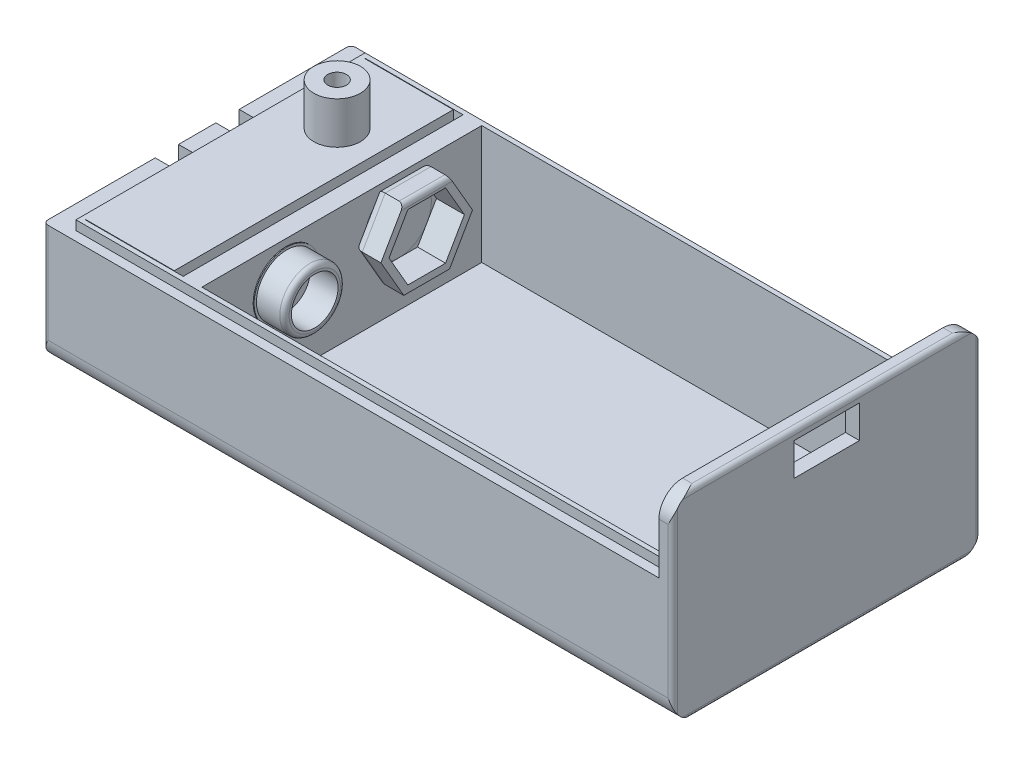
ISO-10303-21;
HEADER;
FILE_DESCRIPTION(('STEP AP214'),'2;1');
FILE_NAME('part.step','',(''),(''),'','','');
FILE_SCHEMA(('AUTOMOTIVE_DESIGN { 1 0 10303 214 1 1 1 1 }'));
ENDSEC;
DATA;
#1=APPLICATION_CONTEXT('core data for automotive mechanical design processes');
#2=APPLICATION_PROTOCOL_DEFINITION('international standard','automotive_design',2000,#1);
#3=PRODUCT_CONTEXT('',#1,'mechanical');
#4=PRODUCT('Part','Part','',(#3));
#5=PRODUCT_RELATED_PRODUCT_CATEGORY('part','',(#4));
#6=PRODUCT_DEFINITION_FORMATION('','',#4);
#7=PRODUCT_DEFINITION_CONTEXT('part definition',#1,'design');
#8=PRODUCT_DEFINITION('design','',#6,#7);
#9=PRODUCT_DEFINITION_SHAPE('','',#8);
#10=(LENGTH_UNIT() NAMED_UNIT(*) SI_UNIT(.MILLI.,.METRE.));
#11=(NAMED_UNIT(*) PLANE_ANGLE_UNIT() SI_UNIT($,.RADIAN.));
#12=(NAMED_UNIT(*) SI_UNIT($,.STERADIAN.) SOLID_ANGLE_UNIT());
#13=UNCERTAINTY_MEASURE_WITH_UNIT(LENGTH_MEASURE(1.E-05),#10,'distance_accuracy_value','');
#14=(GEOMETRIC_REPRESENTATION_CONTEXT(3) GLOBAL_UNCERTAINTY_ASSIGNED_CONTEXT((#13)) GLOBAL_UNIT_ASSIGNED_CONTEXT((#10,
#11,#12)) REPRESENTATION_CONTEXT('',''));
#15=CARTESIAN_POINT('',(0.,0.,0.));
#16=DIRECTION('',(0.,0.,1.));
#17=DIRECTION('',(1.,0.,0.));
#18=AXIS2_PLACEMENT_3D('',#15,#16,#17);
#19=CARTESIAN_POINT('',(-15.6439,3.11649860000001,0.));
#20=DIRECTION('',(0.,0.,-1.));
#21=DIRECTION('',(0.,1.,0.));
#22=AXIS2_PLACEMENT_3D('',#19,#20,#21);
#23=CYLINDRICAL_SURFACE('',#22,0.5);
#24=DIRECTION('',(0.,0.,1.));
#25=VECTOR('',#24,1.);
#26=CARTESIAN_POINT('',(-15.1439,3.11649860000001,0.));
#27=LINE('',#26,#25);
#28=CARTESIAN_POINT('',(-15.1439,3.1164986,-8.74241377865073));
#29=VERTEX_POINT('',#28);
#30=CARTESIAN_POINT('',(-15.1439,3.11649860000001,-3.25758622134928));
#31=VERTEX_POINT('',#30);
#32=EDGE_CURVE('E269',#29,#31,#27,.T.);
#33=ORIENTED_EDGE('',*,*,#32,.F.);
#34=CARTESIAN_POINT('',(-15.6439,3.1164986,-8.74241377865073));
#35=DIRECTION('',(0.,-0.5,0.866025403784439));
#36=DIRECTION('',(0.,-0.866025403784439,-0.5));
#37=AXIS2_PLACEMENT_3D('',#34,#35,#36);
#38=ELLIPSE('',#37,0.577350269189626,0.5);
#39=CARTESIAN_POINT('',(-15.6439,3.6164986,-8.45373864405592));
#40=VERTEX_POINT('',#39);
#41=EDGE_CURVE('E58',#40,#29,#38,.F.);
#42=ORIENTED_EDGE('',*,*,#41,.F.);
#43=DIRECTION('',(0.,0.,1.));
#44=VECTOR('',#43,1.);
#45=CARTESIAN_POINT('',(-15.6439,3.61649860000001,0.));
#46=LINE('',#45,#44);
#47=CARTESIAN_POINT('',(-15.6439,3.6164986,-3.54626135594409));
#48=VERTEX_POINT('',#47);
#49=EDGE_CURVE('E280',#48,#40,#46,.F.);
#50=ORIENTED_EDGE('',*,*,#49,.F.);
#51=CARTESIAN_POINT('',(-15.6439,3.1164986,-3.25758622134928));
#52=DIRECTION('',(0.,-0.5,-0.866025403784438));
#53=DIRECTION('',(0.,0.866025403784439,-0.5));
#54=AXIS2_PLACEMENT_3D('',#51,#52,#53);
#55=ELLIPSE('',#54,0.577350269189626,0.5);
#56=EDGE_CURVE('E13',#31,#48,#55,.F.);
#57=ORIENTED_EDGE('',*,*,#56,.F.);
#58=EDGE_LOOP('',(#33,#42,#50,#57));
#59=FACE_BOUND('',#58,.T.);
#60=ADVANCED_FACE('F51',(#59),#23,.T.);
#61=CARTESIAN_POINT('',(-15.1439,0.,0.));
#62=DIRECTION('',(1.,0.,0.));
#63=DIRECTION('',(0.,0.,-1.));
#64=AXIS2_PLACEMENT_3D('',#61,#62,#63);
#65=PLANE('',#64);
#66=DIRECTION('',(0.,0.866025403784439,0.5));
#67=VECTOR('',#66,1.);
#68=CARTESIAN_POINT('',(-15.1439,-0.633501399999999,-10.9074772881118));
#69=LINE('',#68,#67);
#70=CARTESIAN_POINT('',(-15.1439,-0.633501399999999,-10.9074772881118));
#71=VERTEX_POINT('',#70);
#72=EDGE_CURVE('E212',#71,#29,#69,.T.);
#73=ORIENTED_EDGE('',*,*,#72,.T.);
#74=ORIENTED_EDGE('',*,*,#32,.T.);
#75=DIRECTION('',(0.,-0.866025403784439,0.5));
#76=VECTOR('',#75,1.);
#77=CARTESIAN_POINT('',(-15.1439,3.6164986,-3.54626135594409));
#78=LINE('',#77,#76);
#79=CARTESIAN_POINT('',(-15.1439,-0.633501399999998,-1.09252271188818));
#80=VERTEX_POINT('',#79);
#81=EDGE_CURVE('E215',#31,#80,#78,.T.);
#82=ORIENTED_EDGE('',*,*,#81,.T.);
#83=DIRECTION('',(0.,-0.866025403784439,-0.5));
#84=VECTOR('',#83,1.);
#85=CARTESIAN_POINT('',(-15.1439,-0.633501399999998,-1.09252271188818));
#86=LINE('',#85,#84);
#87=CARTESIAN_POINT('',(-15.1439,-4.8835014,-3.54626135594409));
#88=VERTEX_POINT('',#87);
#89=EDGE_CURVE('E217',#80,#88,#86,.T.);
#90=ORIENTED_EDGE('',*,*,#89,.T.);
#91=DIRECTION('',(0.,0.,-1.));
#92=VECTOR('',#91,1.);
#93=CARTESIAN_POINT('',(-15.1439,-4.8835014,-3.54626135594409));
#94=LINE('',#93,#92);
#95=CARTESIAN_POINT('',(-15.1439,-4.8835014,-8.45373864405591));
#96=VERTEX_POINT('',#95);
#97=EDGE_CURVE('E206',#88,#96,#94,.T.);
#98=ORIENTED_EDGE('',*,*,#97,.T.);
#99=DIRECTION('',(0.,0.866025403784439,-0.5));
#100=VECTOR('',#99,1.);
#101=CARTESIAN_POINT('',(-15.1439,-4.8835014,-8.45373864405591));
#102=LINE('',#101,#100);
#103=EDGE_CURVE('E209',#96,#71,#102,.T.);
#104=ORIENTED_EDGE('',*,*,#103,.T.);
#105=EDGE_LOOP('',(#73,#74,#82,#90,#98,#104));
#106=FACE_BOUND('',#105,.T.);
#107=DIRECTION('',(0.,0.866025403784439,-0.5));
#108=VECTOR('',#107,1.);
#109=CARTESIAN_POINT('',(-15.1439,-4.1335014,-8.02072594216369));
#110=LINE('',#109,#108);
#111=CARTESIAN_POINT('',(-15.1439,-4.1335014,-8.02072594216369));
#112=VERTEX_POINT('',#111);
#113=CARTESIAN_POINT('',(-15.1439,-0.6335014,-10.0414518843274));
#114=VERTEX_POINT('',#113);
#115=EDGE_CURVE('E165',#112,#114,#110,.T.);
#116=ORIENTED_EDGE('',*,*,#115,.F.);
#117=DIRECTION('',(0.,0.,-1.));
#118=VECTOR('',#117,1.);
#119=CARTESIAN_POINT('',(-15.1439,-4.1335014,-3.97927405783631));
#120=LINE('',#119,#118);
#121=CARTESIAN_POINT('',(-15.1439,-4.1335014,-3.97927405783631));
#122=VERTEX_POINT('',#121);
#123=EDGE_CURVE('E155',#122,#112,#120,.T.);
#124=ORIENTED_EDGE('',*,*,#123,.F.);
#125=DIRECTION('',(0.,-0.866025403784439,-0.5));
#126=VECTOR('',#125,1.);
#127=CARTESIAN_POINT('',(-15.1439,-0.633501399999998,-1.95854811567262));
#128=LINE('',#127,#126);
#129=CARTESIAN_POINT('',(-15.1439,-0.633501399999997,-1.95854811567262));
#130=VERTEX_POINT('',#129);
#131=EDGE_CURVE('E189',#130,#122,#128,.T.);
#132=ORIENTED_EDGE('',*,*,#131,.F.);
#133=DIRECTION('',(0.,-0.866025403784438,0.5));
#134=VECTOR('',#133,1.);
#135=CARTESIAN_POINT('',(-15.1439,2.8664986,-3.97927405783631));
#136=LINE('',#135,#134);
#137=CARTESIAN_POINT('',(-15.1439,2.8664986,-3.97927405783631));
#138=VERTEX_POINT('',#137);
#139=EDGE_CURVE('E186',#138,#130,#136,.T.);
#140=ORIENTED_EDGE('',*,*,#139,.F.);
#141=DIRECTION('',(0.,0.,1.));
#142=VECTOR('',#141,1.);
#143=CARTESIAN_POINT('',(-15.1439,2.8664986,-8.02072594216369));
#144=LINE('',#143,#142);
#145=CARTESIAN_POINT('',(-15.1439,2.8664986,-8.02072594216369));
#146=VERTEX_POINT('',#145);
#147=EDGE_CURVE('E182',#146,#138,#144,.T.);
#148=ORIENTED_EDGE('',*,*,#147,.F.);
#149=DIRECTION('',(0.,0.866025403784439,0.5));
#150=VECTOR('',#149,1.);
#151=CARTESIAN_POINT('',(-15.1439,-0.6335014,-10.0414518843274));
#152=LINE('',#151,#150);
#153=EDGE_CURVE('E180',#114,#146,#152,.T.);
#154=ORIENTED_EDGE('',*,*,#153,.F.);
#155=EDGE_LOOP('',(#116,#124,#132,#140,#148,#154));
#156=FACE_BOUND('',#155,.T.);
#157=ADVANCED_FACE('F178',(#106,#156),#65,.T.);
#158=CARTESIAN_POINT('',(-18.1439,0.,0.));
#159=DIRECTION('',(1.,0.,0.));
#160=DIRECTION('',(0.,0.,-1.));
#161=AXIS2_PLACEMENT_3D('',#158,#159,#160);
#162=PLANE('',#161);
#163=DIRECTION('',(0.,0.,-1.));
#164=VECTOR('',#163,1.);
#165=CARTESIAN_POINT('',(-18.1439,-4.8835014,-3.54626135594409));
#166=LINE('',#165,#164);
#167=CARTESIAN_POINT('',(-18.1439,-4.8835014,-4.70096189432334));
#168=VERTEX_POINT('',#167);
#169=CARTESIAN_POINT('',(-18.1439,-4.8835014,-8.45373864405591));
#170=VERTEX_POINT('',#169);
#171=EDGE_CURVE('E174',#168,#170,#166,.T.);
#172=ORIENTED_EDGE('',*,*,#171,.F.);
#173=DIRECTION('',(0.,-0.866025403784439,-0.5));
#174=VECTOR('',#173,1.);
#175=CARTESIAN_POINT('',(-18.1439,0.814700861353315,-1.41110328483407));
#176=LINE('',#175,#174);
#177=CARTESIAN_POINT('',(-18.1439,-4.1335014,-4.26794919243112));
#178=VERTEX_POINT('',#177);
#179=EDGE_CURVE('E245',#168,#178,#176,.F.);
#180=ORIENTED_EDGE('',*,*,#179,.T.);
#181=DIRECTION('',(0.,0.,-1.));
#182=VECTOR('',#181,1.);
#183=CARTESIAN_POINT('',(-18.1439,-4.1335014,-3.97927405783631));
#184=LINE('',#183,#182);
#185=CARTESIAN_POINT('',(-18.1439,-4.1335014,-8.02072594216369));
#186=VERTEX_POINT('',#185);
#187=EDGE_CURVE('E191',#178,#186,#184,.T.);
#188=ORIENTED_EDGE('',*,*,#187,.T.);
#189=DIRECTION('',(0.,0.866025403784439,-0.5));
#190=VECTOR('',#189,1.);
#191=CARTESIAN_POINT('',(-18.1439,-4.1335014,-8.02072594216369));
#192=LINE('',#191,#190);
#193=CARTESIAN_POINT('',(-18.1439,-0.883501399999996,-9.89711431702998));
#194=VERTEX_POINT('',#193);
#195=EDGE_CURVE('E166',#186,#194,#192,.T.);
#196=ORIENTED_EDGE('',*,*,#195,.T.);
#197=DIRECTION('',(0.,0.866025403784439,0.5));
#198=VECTOR('',#197,1.);
#199=CARTESIAN_POINT('',(-18.1439,4.06470086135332,-7.04026840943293));
#200=LINE('',#199,#198);
#201=CARTESIAN_POINT('',(-18.1439,-1.6335014,-10.3301270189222));
#202=VERTEX_POINT('',#201);
#203=EDGE_CURVE('E243',#194,#202,#200,.F.);
#204=ORIENTED_EDGE('',*,*,#203,.T.);
#205=DIRECTION('',(0.,0.866025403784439,-0.5));
#206=VECTOR('',#205,1.);
#207=CARTESIAN_POINT('',(-18.1439,-4.8835014,-8.45373864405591));
#208=LINE('',#207,#206);
#209=EDGE_CURVE('E210',#170,#202,#208,.T.);
#210=ORIENTED_EDGE('',*,*,#209,.F.);
#211=EDGE_LOOP('',(#172,#180,#188,#196,#204,#210));
#212=FACE_BOUND('',#211,.T.);
#213=ADVANCED_FACE('F329',(#212),#162,.F.);
#214=CARTESIAN_POINT('',(-15.1439,-4.8835014,-3.54626135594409));
#215=DIRECTION('',(0.,1.,0.));
#216=DIRECTION('',(-1.,0.,0.));
#217=AXIS2_PLACEMENT_3D('',#214,#215,#216);
#218=PLANE('',#217);
#219=DIRECTION('',(-1.,0.,0.));
#220=VECTOR('',#219,1.);
#221=CARTESIAN_POINT('',(-15.1439,-4.8835014,-3.54626135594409));
#222=LINE('',#221,#220);
#223=CARTESIAN_POINT('',(-17.1439,-4.8835014,-3.54626135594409));
#224=VERTEX_POINT('',#223);
#225=EDGE_CURVE('E219',#88,#224,#222,.T.);
#226=ORIENTED_EDGE('',*,*,#225,.T.);
#227=CARTESIAN_POINT('',(-17.1439,-4.8835014,-4.70096189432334));
#228=DIRECTION('',(0.,1.,0.));
#229=DIRECTION('',(0.,0.,-1.));
#230=AXIS2_PLACEMENT_3D('',#227,#228,#229);
#231=ELLIPSE('',#230,1.15470053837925,1.);
#232=EDGE_CURVE('E241',#224,#168,#231,.F.);
#233=ORIENTED_EDGE('',*,*,#232,.T.);
#234=ORIENTED_EDGE('',*,*,#171,.T.);
#235=DIRECTION('',(-1.,0.,0.));
#236=VECTOR('',#235,1.);
#237=CARTESIAN_POINT('',(-15.1439,-4.8835014,-8.45373864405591));
#238=LINE('',#237,#236);
#239=EDGE_CURVE('E235',#96,#170,#238,.T.);
#240=ORIENTED_EDGE('',*,*,#239,.F.);
#241=ORIENTED_EDGE('',*,*,#97,.F.);
#242=EDGE_LOOP('',(#226,#233,#234,#240,#241));
#243=FACE_BOUND('',#242,.T.);
#244=ADVANCED_FACE('F326',(#243),#218,.F.);
#245=CARTESIAN_POINT('',(-15.1439,-4.8835014,-8.45373864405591));
#246=DIRECTION('',(0.,0.5,0.866025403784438));
#247=DIRECTION('',(0.,-0.866025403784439,0.5));
#248=AXIS2_PLACEMENT_3D('',#245,#246,#247);
#249=PLANE('',#248);
#250=ORIENTED_EDGE('',*,*,#209,.T.);
#251=CARTESIAN_POINT('',(-17.1439,-1.6335014,-10.3301270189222));
#252=DIRECTION('',(0.,0.5,0.866025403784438));
#253=DIRECTION('',(0.,0.866025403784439,-0.5));
#254=AXIS2_PLACEMENT_3D('',#251,#252,#253);
#255=ELLIPSE('',#254,1.15470053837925,1.);
#256=CARTESIAN_POINT('',(-17.1439,-0.633501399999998,-10.9074772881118));
#257=VERTEX_POINT('',#256);
#258=EDGE_CURVE('E267',#202,#257,#255,.F.);
#259=ORIENTED_EDGE('',*,*,#258,.T.);
#260=DIRECTION('',(-1.,0.,0.));
#261=VECTOR('',#260,1.);
#262=CARTESIAN_POINT('',(-15.1439,-0.633501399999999,-10.9074772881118));
#263=LINE('',#262,#261);
#264=EDGE_CURVE('E232',#71,#257,#263,.T.);
#265=ORIENTED_EDGE('',*,*,#264,.F.);
#266=ORIENTED_EDGE('',*,*,#103,.F.);
#267=ORIENTED_EDGE('',*,*,#239,.T.);
#268=EDGE_LOOP('',(#250,#259,#265,#266,#267));
#269=FACE_BOUND('',#268,.T.);
#270=ADVANCED_FACE('F290',(#269),#249,.F.);
#271=CARTESIAN_POINT('',(-15.1439,-0.633501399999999,-10.9074772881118));
#272=DIRECTION('',(0.,-0.5,0.866025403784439));
#273=DIRECTION('',(0.,-0.866025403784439,-0.5));
#274=AXIS2_PLACEMENT_3D('',#271,#272,#273);
#275=PLANE('',#274);
#276=DIRECTION('',(-1.,0.,0.));
#277=VECTOR('',#276,1.);
#278=CARTESIAN_POINT('',(-15.1439,3.6164986,-8.45373864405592));
#279=LINE('',#278,#277);
#280=CARTESIAN_POINT('',(-17.1439,3.6164986,-8.45373864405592));
#281=VERTEX_POINT('',#280);
#282=EDGE_CURVE('E230',#40,#281,#279,.T.);
#283=ORIENTED_EDGE('',*,*,#282,.F.);
#284=ORIENTED_EDGE('',*,*,#41,.T.);
#285=ORIENTED_EDGE('',*,*,#72,.F.);
#286=ORIENTED_EDGE('',*,*,#264,.T.);
#287=DIRECTION('',(0.,0.866025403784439,0.5));
#288=VECTOR('',#287,1.);
#289=CARTESIAN_POINT('',(-17.1439,-0.633501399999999,-10.9074772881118));
#290=LINE('',#289,#288);
#291=EDGE_CURVE('E260',#257,#281,#290,.T.);
#292=ORIENTED_EDGE('',*,*,#291,.T.);
#293=EDGE_LOOP('',(#283,#284,#285,#286,#292));
#294=FACE_BOUND('',#293,.T.);
#295=ADVANCED_FACE('F284',(#294),#275,.F.);
#296=CARTESIAN_POINT('',(-15.1439,3.6164986,-8.45373864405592));
#297=DIRECTION('',(0.,-1.,0.));
#298=DIRECTION('',(1.,0.,0.));
#299=AXIS2_PLACEMENT_3D('',#296,#297,#298);
#300=PLANE('',#299);
#301=DIRECTION('',(-1.,0.,0.));
#302=VECTOR('',#301,1.);
#303=CARTESIAN_POINT('',(-15.1439,3.6164986,-3.54626135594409));
#304=LINE('',#303,#302);
#305=CARTESIAN_POINT('',(-17.1439,3.61649860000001,-3.54626135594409));
#306=VERTEX_POINT('',#305);
#307=EDGE_CURVE('E228',#48,#306,#304,.T.);
#308=ORIENTED_EDGE('',*,*,#307,.F.);
#309=ORIENTED_EDGE('',*,*,#49,.T.);
#310=ORIENTED_EDGE('',*,*,#282,.T.);
#311=DIRECTION('',(0.,0.,1.));
#312=VECTOR('',#311,1.);
#313=CARTESIAN_POINT('',(-17.1439,3.6164986,-8.45373864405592));
#314=LINE('',#313,#312);
#315=EDGE_CURVE('E255',#281,#306,#314,.T.);
#316=ORIENTED_EDGE('',*,*,#315,.T.);
#317=EDGE_LOOP('',(#308,#309,#310,#316));
#318=FACE_BOUND('',#317,.T.);
#319=ADVANCED_FACE('F307',(#318),#300,.F.);
#320=CARTESIAN_POINT('',(-15.1439,3.6164986,-3.54626135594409));
#321=DIRECTION('',(0.,-0.5,-0.866025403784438));
#322=DIRECTION('',(0.,0.866025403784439,-0.5));
#323=AXIS2_PLACEMENT_3D('',#320,#321,#322);
#324=PLANE('',#323);
#325=ORIENTED_EDGE('',*,*,#81,.F.);
#326=ORIENTED_EDGE('',*,*,#56,.T.);
#327=ORIENTED_EDGE('',*,*,#307,.T.);
#328=DIRECTION('',(0.,-0.866025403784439,0.5));
#329=VECTOR('',#328,1.);
#330=CARTESIAN_POINT('',(-17.1439,3.6164986,-3.54626135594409));
#331=LINE('',#330,#329);
#332=CARTESIAN_POINT('',(-17.1439,-0.633501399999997,-1.09252271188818));
#333=VERTEX_POINT('',#332);
#334=EDGE_CURVE('E251',#306,#333,#331,.T.);
#335=ORIENTED_EDGE('',*,*,#334,.T.);
#336=DIRECTION('',(-1.,0.,0.));
#337=VECTOR('',#336,1.);
#338=CARTESIAN_POINT('',(-15.1439,-0.633501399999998,-1.09252271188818));
#339=LINE('',#338,#337);
#340=EDGE_CURVE('E225',#80,#333,#339,.T.);
#341=ORIENTED_EDGE('',*,*,#340,.F.);
#342=EDGE_LOOP('',(#325,#326,#327,#335,#341));
#343=FACE_BOUND('',#342,.T.);
#344=ADVANCED_FACE('F308',(#343),#324,.F.);
#345=CARTESIAN_POINT('',(-15.1439,-0.633501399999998,-1.09252271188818));
#346=DIRECTION('',(0.,0.5,-0.866025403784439));
#347=DIRECTION('',(0.,0.866025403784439,0.5));
#348=AXIS2_PLACEMENT_3D('',#345,#346,#347);
#349=PLANE('',#348);
#350=ORIENTED_EDGE('',*,*,#340,.T.);
#351=DIRECTION('',(0.,-0.866025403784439,-0.5));
#352=VECTOR('',#351,1.);
#353=CARTESIAN_POINT('',(-17.1439,-0.633501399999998,-1.09252271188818));
#354=LINE('',#353,#352);
#355=EDGE_CURVE('E238',#333,#224,#354,.T.);
#356=ORIENTED_EDGE('',*,*,#355,.T.);
#357=ORIENTED_EDGE('',*,*,#225,.F.);
#358=ORIENTED_EDGE('',*,*,#89,.F.);
#359=EDGE_LOOP('',(#350,#356,#357,#358));
#360=FACE_BOUND('',#359,.T.);
#361=ADVANCED_FACE('F314',(#360),#349,.F.);
#362=CARTESIAN_POINT('',(-15.1439,-4.1335014,-3.97927405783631));
#363=DIRECTION('',(0.,1.,0.));
#364=DIRECTION('',(-1.,0.,0.));
#365=AXIS2_PLACEMENT_3D('',#362,#363,#364);
#366=PLANE('',#365);
#367=ORIENTED_EDGE('',*,*,#187,.F.);
#368=CARTESIAN_POINT('',(-17.1439,-4.1335014,-4.26794919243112));
#369=DIRECTION('',(0.,1.,0.));
#370=DIRECTION('',(0.,0.,-1.));
#371=AXIS2_PLACEMENT_3D('',#368,#369,#370);
#372=ELLIPSE('',#371,1.15470053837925,1.);
#373=CARTESIAN_POINT('',(-18.1121458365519,-4.1335014,-3.97927405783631));
#374=VERTEX_POINT('',#373);
#375=EDGE_CURVE('E247',#178,#374,#372,.T.);
#376=ORIENTED_EDGE('',*,*,#375,.T.);
#377=DIRECTION('',(-1.,0.,0.));
#378=VECTOR('',#377,1.);
#379=CARTESIAN_POINT('',(-15.1439,-4.1335014,-3.97927405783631));
#380=LINE('',#379,#378);
#381=EDGE_CURVE('E161',#122,#374,#380,.T.);
#382=ORIENTED_EDGE('',*,*,#381,.F.);
#383=ORIENTED_EDGE('',*,*,#123,.T.);
#384=DIRECTION('',(-1.,0.,0.));
#385=VECTOR('',#384,1.);
#386=CARTESIAN_POINT('',(-15.1439,-4.1335014,-8.02072594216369));
#387=LINE('',#386,#385);
#388=EDGE_CURVE('E159',#112,#186,#387,.T.);
#389=ORIENTED_EDGE('',*,*,#388,.T.);
#390=EDGE_LOOP('',(#367,#376,#382,#383,#389));
#391=FACE_BOUND('',#390,.T.);
#392=ADVANCED_FACE('F158',(#391),#366,.T.);
#393=CARTESIAN_POINT('',(-15.1439,-4.1335014,-8.02072594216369));
#394=DIRECTION('',(0.,0.5,0.866025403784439));
#395=DIRECTION('',(0.,-0.866025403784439,0.5));
#396=AXIS2_PLACEMENT_3D('',#393,#394,#395);
#397=PLANE('',#396);
#398=DIRECTION('',(-1.,0.,0.));
#399=VECTOR('',#398,1.);
#400=CARTESIAN_POINT('',(-15.1439,-0.6335014,-10.0414518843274));
#401=LINE('',#400,#399);
#402=CARTESIAN_POINT('',(-18.1121458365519,-0.633501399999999,-10.0414518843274));
#403=VERTEX_POINT('',#402);
#404=EDGE_CURVE('E175',#114,#403,#401,.T.);
#405=ORIENTED_EDGE('',*,*,#404,.T.);
#406=CARTESIAN_POINT('',(-17.1439,-0.883501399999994,-9.89711431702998));
#407=DIRECTION('',(0.,0.5,0.866025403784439));
#408=DIRECTION('',(0.,0.866025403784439,-0.5));
#409=AXIS2_PLACEMENT_3D('',#406,#407,#408);
#410=ELLIPSE('',#409,1.15470053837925,1.);
#411=EDGE_CURVE('E265',#403,#194,#410,.T.);
#412=ORIENTED_EDGE('',*,*,#411,.T.);
#413=ORIENTED_EDGE('',*,*,#195,.F.);
#414=ORIENTED_EDGE('',*,*,#388,.F.);
#415=ORIENTED_EDGE('',*,*,#115,.T.);
#416=EDGE_LOOP('',(#405,#412,#413,#414,#415));
#417=FACE_BOUND('',#416,.T.);
#418=ADVANCED_FACE('F171',(#417),#397,.T.);
#419=CARTESIAN_POINT('',(-15.1439,-0.6335014,-10.0414518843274));
#420=DIRECTION('',(0.,-0.5,0.866025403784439));
#421=DIRECTION('',(0.,-0.866025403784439,-0.5));
#422=AXIS2_PLACEMENT_3D('',#419,#420,#421);
#423=PLANE('',#422);
#424=DIRECTION('',(-1.,0.,0.));
#425=VECTOR('',#424,1.);
#426=CARTESIAN_POINT('',(-15.1439,2.8664986,-8.02072594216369));
#427=LINE('',#426,#425);
#428=CARTESIAN_POINT('',(-18.1121458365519,2.8664986,-8.02072594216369));
#429=VERTEX_POINT('',#428);
#430=EDGE_CURVE('E202',#146,#429,#427,.T.);
#431=ORIENTED_EDGE('',*,*,#430,.T.);
#432=DIRECTION('',(0.,0.866025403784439,0.5));
#433=VECTOR('',#432,1.);
#434=CARTESIAN_POINT('',(-18.1121458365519,2.8664986,-8.02072594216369));
#435=LINE('',#434,#433);
#436=EDGE_CURVE('E263',#429,#403,#435,.F.);
#437=ORIENTED_EDGE('',*,*,#436,.T.);
#438=ORIENTED_EDGE('',*,*,#404,.F.);
#439=ORIENTED_EDGE('',*,*,#153,.T.);
#440=EDGE_LOOP('',(#431,#437,#438,#439));
#441=FACE_BOUND('',#440,.T.);
#442=ADVANCED_FACE('F331',(#441),#423,.T.);
#443=CARTESIAN_POINT('',(-15.1439,2.8664986,-8.02072594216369));
#444=DIRECTION('',(0.,-1.,0.));
#445=DIRECTION('',(1.,0.,0.));
#446=AXIS2_PLACEMENT_3D('',#443,#444,#445);
#447=PLANE('',#446);
#448=DIRECTION('',(-1.,0.,0.));
#449=VECTOR('',#448,1.);
#450=CARTESIAN_POINT('',(-15.1439,2.8664986,-3.97927405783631));
#451=LINE('',#450,#449);
#452=CARTESIAN_POINT('',(-18.1121458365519,2.8664986,-3.97927405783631));
#453=VERTEX_POINT('',#452);
#454=EDGE_CURVE('E199',#138,#453,#451,.T.);
#455=ORIENTED_EDGE('',*,*,#454,.T.);
#456=DIRECTION('',(0.,0.,1.));
#457=VECTOR('',#456,1.);
#458=CARTESIAN_POINT('',(-18.1121458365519,2.8664986,-6.));
#459=LINE('',#458,#457);
#460=EDGE_CURVE('E258',#453,#429,#459,.F.);
#461=ORIENTED_EDGE('',*,*,#460,.T.);
#462=ORIENTED_EDGE('',*,*,#430,.F.);
#463=ORIENTED_EDGE('',*,*,#147,.T.);
#464=EDGE_LOOP('',(#455,#461,#462,#463));
#465=FACE_BOUND('',#464,.T.);
#466=ADVANCED_FACE('F334',(#465),#447,.T.);
#467=CARTESIAN_POINT('',(-15.1439,2.8664986,-3.97927405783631));
#468=DIRECTION('',(0.,-0.5,-0.866025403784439));
#469=DIRECTION('',(0.,0.866025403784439,-0.5));
#470=AXIS2_PLACEMENT_3D('',#467,#468,#469);
#471=PLANE('',#470);
#472=DIRECTION('',(-1.,0.,0.));
#473=VECTOR('',#472,1.);
#474=CARTESIAN_POINT('',(-15.1439,-0.633501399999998,-1.95854811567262));
#475=LINE('',#474,#473);
#476=CARTESIAN_POINT('',(-18.1121458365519,-0.633501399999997,-1.95854811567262));
#477=VERTEX_POINT('',#476);
#478=EDGE_CURVE('E196',#130,#477,#475,.T.);
#479=ORIENTED_EDGE('',*,*,#478,.T.);
#480=DIRECTION('',(0.,-0.866025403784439,0.5));
#481=VECTOR('',#480,1.);
#482=CARTESIAN_POINT('',(-18.1121458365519,1.1164986,-2.96891108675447));
#483=LINE('',#482,#481);
#484=EDGE_CURVE('E253',#477,#453,#483,.F.);
#485=ORIENTED_EDGE('',*,*,#484,.T.);
#486=ORIENTED_EDGE('',*,*,#454,.F.);
#487=ORIENTED_EDGE('',*,*,#139,.T.);
#488=EDGE_LOOP('',(#479,#485,#486,#487));
#489=FACE_BOUND('',#488,.T.);
#490=ADVANCED_FACE('F338',(#489),#471,.T.);
#491=CARTESIAN_POINT('',(-15.1439,-0.633501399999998,-1.95854811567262));
#492=DIRECTION('',(0.,0.5,-0.866025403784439));
#493=DIRECTION('',(0.,0.866025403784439,0.5));
#494=AXIS2_PLACEMENT_3D('',#491,#492,#493);
#495=PLANE('',#494);
#496=ORIENTED_EDGE('',*,*,#381,.T.);
#497=DIRECTION('',(0.,-0.866025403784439,-0.5));
#498=VECTOR('',#497,1.);
#499=CARTESIAN_POINT('',(-18.1121458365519,-4.1335014,-3.97927405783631));
#500=LINE('',#499,#498);
#501=EDGE_CURVE('E249',#374,#477,#500,.F.);
#502=ORIENTED_EDGE('',*,*,#501,.T.);
#503=ORIENTED_EDGE('',*,*,#478,.F.);
#504=ORIENTED_EDGE('',*,*,#131,.T.);
#505=EDGE_LOOP('',(#496,#502,#503,#504));
#506=FACE_BOUND('',#505,.T.);
#507=ADVANCED_FACE('F340',(#506),#495,.T.);
#508=CARTESIAN_POINT('',(-17.1439,-1.1335014,-10.0414518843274));
#509=DIRECTION('',(0.,0.866025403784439,0.5));
#510=DIRECTION('',(0.,-0.5,0.866025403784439));
#511=AXIS2_PLACEMENT_3D('',#508,#509,#510);
#512=CYLINDRICAL_SURFACE('',#511,1.);
#513=ORIENTED_EDGE('',*,*,#411,.F.);
#514=ORIENTED_EDGE('',*,*,#436,.F.);
#515=CARTESIAN_POINT('',(-17.1439,2.6164986,-7.87638837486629));
#516=DIRECTION('',(0.,0.5,0.866025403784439));
#517=DIRECTION('',(0.,0.866025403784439,-0.5));
#518=AXIS2_PLACEMENT_3D('',#515,#516,#517);
#519=ELLIPSE('',#518,1.15470053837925,1.);
#520=EDGE_CURVE('E193',#281,#429,#519,.T.);
#521=ORIENTED_EDGE('',*,*,#520,.F.);
#522=ORIENTED_EDGE('',*,*,#291,.F.);
#523=ORIENTED_EDGE('',*,*,#258,.F.);
#524=ORIENTED_EDGE('',*,*,#203,.F.);
#525=EDGE_LOOP('',(#513,#514,#521,#522,#523,#524));
#526=FACE_BOUND('',#525,.T.);
#527=ADVANCED_FACE('F296',(#526),#512,.T.);
#528=CARTESIAN_POINT('',(-17.1439,2.6164986,-8.45373864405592));
#529=DIRECTION('',(0.,0.,1.));
#530=DIRECTION('',(0.,-1.,0.));
#531=AXIS2_PLACEMENT_3D('',#528,#529,#530);
#532=CYLINDRICAL_SURFACE('',#531,1.);
#533=ORIENTED_EDGE('',*,*,#520,.T.);
#534=ORIENTED_EDGE('',*,*,#460,.F.);
#535=CARTESIAN_POINT('',(-17.1439,2.61649860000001,-4.12361162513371));
#536=DIRECTION('',(0.,-0.5,0.866025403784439));
#537=DIRECTION('',(0.,0.866025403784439,0.5));
#538=AXIS2_PLACEMENT_3D('',#535,#536,#537);
#539=ELLIPSE('',#538,1.15470053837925,1.);
#540=EDGE_CURVE('E273',#306,#453,#539,.T.);
#541=ORIENTED_EDGE('',*,*,#540,.F.);
#542=ORIENTED_EDGE('',*,*,#315,.F.);
#543=EDGE_LOOP('',(#533,#534,#541,#542));
#544=FACE_BOUND('',#543,.T.);
#545=ADVANCED_FACE('F303',(#544),#532,.T.);
#546=CARTESIAN_POINT('',(-17.1439,3.1164986,-4.41228675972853));
#547=DIRECTION('',(0.,-0.866025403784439,0.5));
#548=DIRECTION('',(0.,-0.5,-0.866025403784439));
#549=AXIS2_PLACEMENT_3D('',#546,#547,#548);
#550=CYLINDRICAL_SURFACE('',#549,1.);
#551=ORIENTED_EDGE('',*,*,#540,.T.);
#552=ORIENTED_EDGE('',*,*,#484,.F.);
#553=CARTESIAN_POINT('',(-17.1439,-0.633501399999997,-2.24722325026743));
#554=DIRECTION('',(0.,-1.,0.));
#555=DIRECTION('',(0.,0.,1.));
#556=AXIS2_PLACEMENT_3D('',#553,#554,#555);
#557=ELLIPSE('',#556,1.15470053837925,1.);
#558=EDGE_CURVE('E270',#333,#477,#557,.T.);
#559=ORIENTED_EDGE('',*,*,#558,.F.);
#560=ORIENTED_EDGE('',*,*,#334,.F.);
#561=EDGE_LOOP('',(#551,#552,#559,#560));
#562=FACE_BOUND('',#561,.T.);
#563=ADVANCED_FACE('F318',(#562),#550,.T.);
#564=CARTESIAN_POINT('',(-17.1439,-0.133501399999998,-1.95854811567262));
#565=DIRECTION('',(0.,-0.866025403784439,-0.5));
#566=DIRECTION('',(0.,0.5,-0.866025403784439));
#567=AXIS2_PLACEMENT_3D('',#564,#565,#566);
#568=CYLINDRICAL_SURFACE('',#567,1.);
#569=ORIENTED_EDGE('',*,*,#375,.F.);
#570=ORIENTED_EDGE('',*,*,#179,.F.);
#571=ORIENTED_EDGE('',*,*,#232,.F.);
#572=ORIENTED_EDGE('',*,*,#355,.F.);
#573=ORIENTED_EDGE('',*,*,#558,.T.);
#574=ORIENTED_EDGE('',*,*,#501,.F.);
#575=EDGE_LOOP('',(#569,#570,#571,#572,#573,#574));
#576=FACE_BOUND('',#575,.T.);
#577=ADVANCED_FACE('F322',(#576),#568,.T.);
#578=CLOSED_SHELL('',(#60,#157,#213,#244,#270,#295,#319,#344,#361,#392,#418,#442,#466,#490,#507,
#527,#545,#563,#577));
#579=MANIFOLD_SOLID_BREP('B2',#578);
#580=CARTESIAN_POINT('',(-33.7439,10.1045,16.4973));
#581=DIRECTION('',(1.,0.,0.));
#582=DIRECTION('',(0.,1.,0.));
#583=AXIS2_PLACEMENT_3D('',#580,#581,#582);
#584=PLANE('',#583);
#585=DIRECTION('',(0.,0.,-1.));
#586=VECTOR('',#585,1.);
#587=CARTESIAN_POINT('',(-33.7439,1.1044886,2.));
#588=LINE('',#587,#586);
#589=CARTESIAN_POINT('',(-33.7439,1.1044886,2.));
#590=VERTEX_POINT('',#589);
#591=CARTESIAN_POINT('',(-33.7439,1.1044886,-2.));
#592=VERTEX_POINT('',#591);
#593=EDGE_CURVE('E875',#590,#592,#588,.T.);
#594=ORIENTED_EDGE('',*,*,#593,.F.);
#595=DIRECTION('',(0.,-1.,0.));
#596=VECTOR('',#595,1.);
#597=CARTESIAN_POINT('',(-33.7439,2.6044886,2.));
#598=LINE('',#597,#596);
#599=CARTESIAN_POINT('',(-33.7439,2.6044886,2.));
#600=VERTEX_POINT('',#599);
#601=EDGE_CURVE('E852',#600,#590,#598,.T.);
#602=ORIENTED_EDGE('',*,*,#601,.F.);
#603=DIRECTION('',(0.,0.,1.));
#604=VECTOR('',#603,1.);
#605=CARTESIAN_POINT('',(-33.7439,2.60448860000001,15.9973));
#606=LINE('',#605,#604);
#607=CARTESIAN_POINT('',(-33.7439,2.6044886,-2.));
#608=VERTEX_POINT('',#607);
#609=EDGE_CURVE('E1045',#608,#600,#606,.T.);
#610=ORIENTED_EDGE('',*,*,#609,.F.);
#611=DIRECTION('',(0.,1.,0.));
#612=VECTOR('',#611,1.);
#613=CARTESIAN_POINT('',(-33.7439,1.1044886,-2.));
#614=LINE('',#613,#612);
#615=EDGE_CURVE('E872',#592,#608,#614,.T.);
#616=ORIENTED_EDGE('',*,*,#615,.F.);
#617=EDGE_LOOP('',(#594,#602,#610,#616));
#618=FACE_BOUND('',#617,.T.);
#619=ADVANCED_FACE('F495',(#618),#584,.F.);
#620=CARTESIAN_POINT('',(-33.2439,2.60448860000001,15.9973));
#621=DIRECTION('',(0.,1.,0.));
#622=DIRECTION('',(-1.,0.,0.));
#623=AXIS2_PLACEMENT_3D('',#620,#621,#622);
#624=PLANE('',#623);
#625=DIRECTION('',(-1.,0.,0.));
#626=VECTOR('',#625,1.);
#627=CARTESIAN_POINT('',(-20.948269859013,2.60448860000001,2.));
#628=LINE('',#627,#626);
#629=CARTESIAN_POINT('',(-31.2439,2.60448860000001,2.));
#630=VERTEX_POINT('',#629);
#631=EDGE_CURVE('E921',#630,#600,#628,.T.);
#632=ORIENTED_EDGE('',*,*,#631,.F.);
#633=DIRECTION('',(0.,0.,-1.));
#634=VECTOR('',#633,1.);
#635=CARTESIAN_POINT('',(-31.2439,2.6044886,15.4973));
#636=LINE('',#635,#634);
#637=CARTESIAN_POINT('',(-31.2439,2.60448860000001,-2.));
#638=VERTEX_POINT('',#637);
#639=EDGE_CURVE('E1025',#630,#638,#636,.T.);
#640=ORIENTED_EDGE('',*,*,#639,.T.);
#641=DIRECTION('',(-1.,0.,0.));
#642=VECTOR('',#641,1.);
#643=CARTESIAN_POINT('',(-20.948269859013,2.60448860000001,-2.));
#644=LINE('',#643,#642);
#645=EDGE_CURVE('E913',#638,#608,#644,.T.);
#646=ORIENTED_EDGE('',*,*,#645,.T.);
#647=ORIENTED_EDGE('',*,*,#609,.T.);
#648=EDGE_LOOP('',(#632,#640,#646,#647));
#649=FACE_BOUND('',#648,.T.);
#650=ADVANCED_FACE('F1341',(#649),#624,.T.);
#651=DIRECTION('',(-1.,0.,0.));
#652=VECTOR('',#651,1.);
#653=CARTESIAN_POINT('',(-20.948269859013,2.60448860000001,-4.5));
#654=LINE('',#653,#652);
#655=CARTESIAN_POINT('',(-31.2439,2.60448860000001,-4.5));
#656=VERTEX_POINT('',#655);
#657=CARTESIAN_POINT('',(-33.7439,2.6044886,-4.5));
#658=VERTEX_POINT('',#657);
#659=EDGE_CURVE('E909',#656,#658,#654,.T.);
#660=ORIENTED_EDGE('',*,*,#659,.F.);
#661=CARTESIAN_POINT('',(-31.2439,2.6044886,-15.4973));
#662=VERTEX_POINT('',#661);
#663=EDGE_CURVE('E1020',#656,#662,#636,.T.);
#664=ORIENTED_EDGE('',*,*,#663,.T.);
#665=DIRECTION('',(1.,0.,0.));
#666=VECTOR('',#665,1.);
#667=CARTESIAN_POINT('',(-31.2439,2.6044886,-15.4973));
#668=LINE('',#667,#666);
#669=CARTESIAN_POINT('',(32.2439,2.60448859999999,-15.4973));
#670=VERTEX_POINT('',#669);
#671=EDGE_CURVE('E1024',#662,#670,#668,.T.);
#672=ORIENTED_EDGE('',*,*,#671,.T.);
#673=DIRECTION('',(0.,0.,-1.));
#674=VECTOR('',#673,1.);
#675=CARTESIAN_POINT('',(32.2439,2.60448859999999,-16.4973));
#676=LINE('',#675,#674);
#677=CARTESIAN_POINT('',(32.2439,2.60448859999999,-16.4973));
#678=VERTEX_POINT('',#677);
#679=EDGE_CURVE('E1029',#670,#678,#676,.T.);
#680=ORIENTED_EDGE('',*,*,#679,.T.);
#681=DIRECTION('',(-1.,0.,0.));
#682=VECTOR('',#681,1.);
#683=CARTESIAN_POINT('',(-33.2439,2.60448860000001,-16.4973));
#684=LINE('',#683,#682);
#685=CARTESIAN_POINT('',(-33.2439,2.60448860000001,-16.4973));
#686=VERTEX_POINT('',#685);
#687=EDGE_CURVE('E1033',#678,#686,#684,.T.);
#688=ORIENTED_EDGE('',*,*,#687,.T.);
#689=CARTESIAN_POINT('',(-33.2439,2.60448860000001,-15.9973));
#690=DIRECTION('',(0.,1.,0.));
#691=DIRECTION('',(-1.,0.,0.));
#692=AXIS2_PLACEMENT_3D('',#689,#690,#691);
#693=CIRCLE('',#692,0.5);
#694=CARTESIAN_POINT('',(-33.7439,2.60448860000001,-15.9973));
#695=VERTEX_POINT('',#694);
#696=EDGE_CURVE('E1036',#686,#695,#693,.T.);
#697=ORIENTED_EDGE('',*,*,#696,.T.);
#698=EDGE_CURVE('E1040',#695,#658,#606,.T.);
#699=ORIENTED_EDGE('',*,*,#698,.T.);
#700=EDGE_LOOP('',(#660,#664,#672,#680,#688,#697,#699));
#701=FACE_BOUND('',#700,.T.);
#702=ADVANCED_FACE('F1331',(#701),#624,.T.);
#703=CARTESIAN_POINT('',(-15.6439,-0.633501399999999,6.));
#704=DIRECTION('',(1.,0.,0.));
#705=DIRECTION('',(0.,1.,0.));
#706=AXIS2_PLACEMENT_3D('',#703,#704,#705);
#707=TOROIDAL_SURFACE('',#706,2.75,0.5);
#708=CARTESIAN_POINT('',(-15.1439,-0.633501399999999,6.));
#709=DIRECTION('',(1.,0.,0.));
#710=DIRECTION('',(0.,1.,0.));
#711=AXIS2_PLACEMENT_3D('',#708,#709,#710);
#712=CIRCLE('',#711,2.75);
#713=CARTESIAN_POINT('',(-15.1439,2.1164986,6.));
#714=VERTEX_POINT('',#713);
#715=EDGE_CURVE('E1319',#714,#714,#712,.T.);
#716=ORIENTED_EDGE('',*,*,#715,.F.);
#717=EDGE_LOOP('',(#716));
#718=FACE_BOUND('',#717,.T.);
#719=CARTESIAN_POINT('',(-15.6439,-0.633501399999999,6.));
#720=DIRECTION('',(1.,0.,0.));
#721=DIRECTION('',(0.,1.,0.));
#722=AXIS2_PLACEMENT_3D('',#719,#720,#721);
#723=CIRCLE('',#722,3.25);
#724=CARTESIAN_POINT('',(-15.6439,2.6164986,6.));
#725=VERTEX_POINT('',#724);
#726=EDGE_CURVE('E504',#725,#725,#723,.F.);
#727=ORIENTED_EDGE('',*,*,#726,.F.);
#728=EDGE_LOOP('',(#727));
#729=FACE_BOUND('',#728,.T.);
#730=ADVANCED_FACE('F497',(#718,#729),#707,.T.);
#731=CARTESIAN_POINT('',(-30.7439,-80.369383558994,14.9973));
#732=DIRECTION('',(0.,0.,1.));
#733=DIRECTION('',(1.,0.,0.));
#734=AXIS2_PLACEMENT_3D('',#731,#732,#733);
#735=PLANE('',#734);
#736=DIRECTION('',(-1.,0.,0.));
#737=VECTOR('',#736,1.);
#738=CARTESIAN_POINT('',(-30.7439,-9.1045,14.9973));
#739=LINE('',#738,#737);
#740=CARTESIAN_POINT('',(32.2439,-9.10449999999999,14.9973));
#741=VERTEX_POINT('',#740);
#742=CARTESIAN_POINT('',(-18.2439,-9.1045,14.9973));
#743=VERTEX_POINT('',#742);
#744=EDGE_CURVE('E1116',#741,#743,#739,.T.);
#745=ORIENTED_EDGE('',*,*,#744,.T.);
#746=DIRECTION('',(0.,1.,0.));
#747=VECTOR('',#746,1.);
#748=CARTESIAN_POINT('',(-18.2439,-10.6065,14.9973));
#749=LINE('',#748,#747);
#750=CARTESIAN_POINT('',(-18.2439,3.6044886,14.9973));
#751=VERTEX_POINT('',#750);
#752=EDGE_CURVE('E989',#743,#751,#749,.T.);
#753=ORIENTED_EDGE('',*,*,#752,.T.);
#754=DIRECTION('',(1.,0.,0.));
#755=VECTOR('',#754,1.);
#756=CARTESIAN_POINT('',(-30.7439,3.6044886,14.9973));
#757=LINE('',#756,#755);
#758=CARTESIAN_POINT('',(32.2439,3.60448859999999,14.9973));
#759=VERTEX_POINT('',#758);
#760=EDGE_CURVE('E1110',#751,#759,#757,.T.);
#761=ORIENTED_EDGE('',*,*,#760,.T.);
#762=DIRECTION('',(0.,1.,0.));
#763=VECTOR('',#762,1.);
#764=CARTESIAN_POINT('',(32.2439,-80.3693835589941,14.9973));
#765=LINE('',#764,#763);
#766=EDGE_CURVE('E1115',#741,#759,#765,.T.);
#767=ORIENTED_EDGE('',*,*,#766,.F.);
#768=EDGE_LOOP('',(#745,#753,#761,#767));
#769=FACE_BOUND('',#768,.T.);
#770=ADVANCED_FACE('F1330',(#769),#735,.F.);
#771=CARTESIAN_POINT('',(32.2439,-80.3693835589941,-14.9973));
#772=DIRECTION('',(0.,0.,-1.));
#773=DIRECTION('',(-1.,0.,0.));
#774=AXIS2_PLACEMENT_3D('',#771,#772,#773);
#775=PLANE('',#774);
#776=DIRECTION('',(-1.,0.,0.));
#777=VECTOR('',#776,1.);
#778=CARTESIAN_POINT('',(32.2439,3.60448859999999,-14.9973));
#779=LINE('',#778,#777);
#780=CARTESIAN_POINT('',(32.2439,3.6044886,-14.9973));
#781=VERTEX_POINT('',#780);
#782=CARTESIAN_POINT('',(-18.2439,3.6044886,-14.9973));
#783=VERTEX_POINT('',#782);
#784=EDGE_CURVE('E1134',#781,#783,#779,.T.);
#785=ORIENTED_EDGE('',*,*,#784,.T.);
#786=DIRECTION('',(0.,1.,0.));
#787=VECTOR('',#786,1.);
#788=CARTESIAN_POINT('',(-18.2439,-10.6065,-14.9973));
#789=LINE('',#788,#787);
#790=CARTESIAN_POINT('',(-18.2439,-9.1045,-14.9973));
#791=VERTEX_POINT('',#790);
#792=EDGE_CURVE('E992',#791,#783,#789,.T.);
#793=ORIENTED_EDGE('',*,*,#792,.F.);
#794=DIRECTION('',(1.,0.,0.));
#795=VECTOR('',#794,1.);
#796=CARTESIAN_POINT('',(32.2439,-9.10449999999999,-14.9973));
#797=LINE('',#796,#795);
#798=CARTESIAN_POINT('',(32.2439,-9.10449999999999,-14.9973));
#799=VERTEX_POINT('',#798);
#800=EDGE_CURVE('E1124',#791,#799,#797,.T.);
#801=ORIENTED_EDGE('',*,*,#800,.T.);
#802=DIRECTION('',(0.,1.,0.));
#803=VECTOR('',#802,1.);
#804=CARTESIAN_POINT('',(32.2439,-80.3693835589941,-14.9973));
#805=LINE('',#804,#803);
#806=EDGE_CURVE('E1137',#799,#781,#805,.T.);
#807=ORIENTED_EDGE('',*,*,#806,.T.);
#808=EDGE_LOOP('',(#785,#793,#801,#807));
#809=FACE_BOUND('',#808,.T.);
#810=ADVANCED_FACE('F1337',(#809),#775,.F.);
#811=CARTESIAN_POINT('',(-33.2439,-9.1045,16.4973));
#812=DIRECTION('',(0.,1.,0.));
#813=DIRECTION('',(-1.,0.,0.));
#814=AXIS2_PLACEMENT_3D('',#811,#812,#813);
#815=PLANE('',#814);
#816=DIRECTION('',(0.,0.,1.));
#817=VECTOR('',#816,1.);
#818=CARTESIAN_POINT('',(-18.2439,-9.1045,-14.9973));
#819=LINE('',#818,#817);
#820=EDGE_CURVE('E998',#791,#743,#819,.T.);
#821=ORIENTED_EDGE('',*,*,#820,.T.);
#822=ORIENTED_EDGE('',*,*,#744,.F.);
#823=DIRECTION('',(0.,0.,-1.));
#824=VECTOR('',#823,1.);
#825=CARTESIAN_POINT('',(32.2439,-9.10449999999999,-14.9973));
#826=LINE('',#825,#824);
#827=EDGE_CURVE('E1120',#741,#799,#826,.T.);
#828=ORIENTED_EDGE('',*,*,#827,.T.);
#829=ORIENTED_EDGE('',*,*,#800,.F.);
#830=EDGE_LOOP('',(#821,#822,#828,#829));
#831=FACE_BOUND('',#830,.T.);
#832=ADVANCED_FACE('F1358',(#831),#815,.T.);
#833=CARTESIAN_POINT('',(-33.7439,-1.3955114,-10.4973));
#834=DIRECTION('',(-1.,0.,0.));
#835=DIRECTION('',(0.,-1.,0.));
#836=AXIS2_PLACEMENT_3D('',#833,#834,#835);
#837=CIRCLE('',#836,2.5);
#838=CARTESIAN_POINT('',(-33.7439,-3.8955114,-10.4973));
#839=VERTEX_POINT('',#838);
#840=EDGE_CURVE('E945',#839,#839,#837,.T.);
#841=ORIENTED_EDGE('',*,*,#840,.F.);
#842=EDGE_LOOP('',(#841));
#843=FACE_BOUND('',#842,.T.);
#844=CARTESIAN_POINT('',(-33.7439,-1.39551139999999,-3.5));
#845=DIRECTION('',(-1.,0.,0.));
#846=DIRECTION('',(0.,1.,0.));
#847=AXIS2_PLACEMENT_3D('',#844,#845,#846);
#848=CIRCLE('',#847,1.);
#849=CARTESIAN_POINT('',(-33.7439,-1.39551139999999,-4.5));
#850=VERTEX_POINT('',#849);
#851=CARTESIAN_POINT('',(-33.7439,-2.39551139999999,-3.5));
#852=VERTEX_POINT('',#851);
#853=EDGE_CURVE('E864',#850,#852,#848,.T.);
#854=ORIENTED_EDGE('',*,*,#853,.F.);
#855=DIRECTION('',(0.,-1.,0.));
#856=VECTOR('',#855,1.);
#857=CARTESIAN_POINT('',(-33.7439,-1.39551139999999,-4.5));
#858=LINE('',#857,#856);
#859=EDGE_CURVE('E868',#658,#850,#858,.T.);
#860=ORIENTED_EDGE('',*,*,#859,.F.);
#861=ORIENTED_EDGE('',*,*,#698,.F.);
#862=DIRECTION('',(0.,-1.,0.));
#863=VECTOR('',#862,1.);
#864=CARTESIAN_POINT('',(-33.7439,-8.0645,-15.9973));
#865=LINE('',#864,#863);
#866=CARTESIAN_POINT('',(-33.7439,-9.57777459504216,-15.9973));
#867=VERTEX_POINT('',#866);
#868=EDGE_CURVE('E1421',#695,#867,#865,.T.);
#869=ORIENTED_EDGE('',*,*,#868,.T.);
#870=CARTESIAN_POINT('',(-33.7439,-8.0645,-13.9573));
#871=DIRECTION('',(1.,0.,0.));
#872=DIRECTION('',(0.,1.,0.));
#873=AXIS2_PLACEMENT_3D('',#870,#871,#872);
#874=CIRCLE('',#873,2.54);
#875=CARTESIAN_POINT('',(-33.7439,-10.1045,-15.4705745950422));
#876=VERTEX_POINT('',#875);
#877=EDGE_CURVE('E1458',#867,#876,#874,.F.);
#878=ORIENTED_EDGE('',*,*,#877,.T.);
#879=DIRECTION('',(0.,0.,-1.));
#880=VECTOR('',#879,1.);
#881=CARTESIAN_POINT('',(-33.7439,-10.1045,16.4973));
#882=LINE('',#881,#880);
#883=CARTESIAN_POINT('',(-33.7439,-10.1045,15.4705745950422));
#884=VERTEX_POINT('',#883);
#885=EDGE_CURVE('E1190',#884,#876,#882,.T.);
#886=ORIENTED_EDGE('',*,*,#885,.F.);
#887=CARTESIAN_POINT('',(-33.7439,-8.0645,13.9573));
#888=DIRECTION('',(1.,0.,0.));
#889=DIRECTION('',(0.,1.,0.));
#890=AXIS2_PLACEMENT_3D('',#887,#888,#889);
#891=CIRCLE('',#890,2.54);
#892=CARTESIAN_POINT('',(-33.7439,-9.57777459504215,15.9973));
#893=VERTEX_POINT('',#892);
#894=EDGE_CURVE('E1419',#884,#893,#891,.F.);
#895=ORIENTED_EDGE('',*,*,#894,.T.);
#896=DIRECTION('',(0.,-1.,0.));
#897=VECTOR('',#896,1.);
#898=CARTESIAN_POINT('',(-33.7439,10.1045,15.9973));
#899=LINE('',#898,#897);
#900=CARTESIAN_POINT('',(-33.7439,2.60448860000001,15.9973));
#901=VERTEX_POINT('',#900);
#902=EDGE_CURVE('E1414',#893,#901,#899,.F.);
#903=ORIENTED_EDGE('',*,*,#902,.T.);
#904=CARTESIAN_POINT('',(-33.7439,2.60448860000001,4.5));
#905=VERTEX_POINT('',#904);
#906=EDGE_CURVE('E1039',#905,#901,#606,.T.);
#907=ORIENTED_EDGE('',*,*,#906,.F.);
#908=DIRECTION('',(0.,1.,0.));
#909=VECTOR('',#908,1.);
#910=CARTESIAN_POINT('',(-33.7439,2.6044886,4.5));
#911=LINE('',#910,#909);
#912=CARTESIAN_POINT('',(-33.7439,-1.39551139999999,4.5));
#913=VERTEX_POINT('',#912);
#914=EDGE_CURVE('E519',#913,#905,#911,.T.);
#915=ORIENTED_EDGE('',*,*,#914,.F.);
#916=CARTESIAN_POINT('',(-33.7439,-1.39551139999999,3.5));
#917=DIRECTION('',(-1.,0.,0.));
#918=DIRECTION('',(0.,1.,0.));
#919=AXIS2_PLACEMENT_3D('',#916,#917,#918);
#920=CIRCLE('',#919,1.);
#921=CARTESIAN_POINT('',(-33.7439,-2.39551139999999,3.5));
#922=VERTEX_POINT('',#921);
#923=EDGE_CURVE('E856',#922,#913,#920,.T.);
#924=ORIENTED_EDGE('',*,*,#923,.F.);
#925=DIRECTION('',(0.,0.,1.));
#926=VECTOR('',#925,1.);
#927=CARTESIAN_POINT('',(-33.7439,-2.3955114,3.5));
#928=LINE('',#927,#926);
#929=EDGE_CURVE('E860',#852,#922,#928,.T.);
#930=ORIENTED_EDGE('',*,*,#929,.F.);
#931=EDGE_LOOP('',(#854,#860,#861,#869,#878,#886,#895,#903,#907,#915,#924,#930));
#932=FACE_BOUND('',#931,.T.);
#933=ADVANCED_FACE('F1349',(#843,#932),#584,.F.);
#934=CARTESIAN_POINT('',(-33.2439,10.1045,15.9973));
#935=DIRECTION('',(0.,-1.,0.));
#936=DIRECTION('',(1.,0.,0.));
#937=AXIS2_PLACEMENT_3D('',#934,#935,#936);
#938=CYLINDRICAL_SURFACE('',#937,0.5);
#939=DIRECTION('',(0.,-1.,0.));
#940=VECTOR('',#939,1.);
#941=CARTESIAN_POINT('',(-33.2439,10.1045,16.4973));
#942=LINE('',#941,#940);
#943=CARTESIAN_POINT('',(-33.2439,2.60448860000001,16.4973));
#944=VERTEX_POINT('',#943);
#945=CARTESIAN_POINT('',(-33.2439,-8.0645,16.4973));
#946=VERTEX_POINT('',#945);
#947=EDGE_CURVE('E1415',#944,#946,#942,.T.);
#948=ORIENTED_EDGE('',*,*,#947,.F.);
#949=CARTESIAN_POINT('',(-33.2439,2.60448860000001,15.9973));
#950=DIRECTION('',(0.,1.,0.));
#951=DIRECTION('',(-1.,0.,0.));
#952=AXIS2_PLACEMENT_3D('',#949,#950,#951);
#953=CIRCLE('',#952,0.5);
#954=EDGE_CURVE('E1004',#901,#944,#953,.T.);
#955=ORIENTED_EDGE('',*,*,#954,.F.);
#956=ORIENTED_EDGE('',*,*,#902,.F.);
#957=CARTESIAN_POINT('',(-33.7439,-9.57777459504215,15.9973));
#958=CARTESIAN_POINT('',(-33.7438807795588,-9.54568477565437,16.0211108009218));
#959=CARTESIAN_POINT('',(-33.7422012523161,-9.51306111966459,16.0441308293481));
#960=CARTESIAN_POINT('',(-33.7360325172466,-9.44701106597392,16.0884580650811));
#961=CARTESIAN_POINT('',(-33.7315486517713,-9.41358631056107,16.1097684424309));
#962=CARTESIAN_POINT('',(-33.7203158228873,-9.34630057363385,16.1505000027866));
#963=CARTESIAN_POINT('',(-33.7135821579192,-9.31244398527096,16.1699328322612));
#964=CARTESIAN_POINT('',(-33.6982162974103,-9.2441927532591,16.2070633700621));
#965=CARTESIAN_POINT('',(-33.6895828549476,-9.20979777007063,16.2247599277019));
#966=CARTESIAN_POINT('',(-33.6646879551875,-9.11835387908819,16.2692223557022));
#967=CARTESIAN_POINT('',(-33.6470889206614,-9.06094507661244,16.2945120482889));
#968=CARTESIAN_POINT('',(-33.6087554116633,-8.94535490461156,16.3404846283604));
#969=CARTESIAN_POINT('',(-33.5880195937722,-8.88717321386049,16.361165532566));
#970=CARTESIAN_POINT('',(-33.5222359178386,-8.71138562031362,16.4166228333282));
#971=CARTESIAN_POINT('',(-33.4737143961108,-8.59287713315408,16.4446512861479));
#972=CARTESIAN_POINT('',(-33.3947947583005,-8.40741228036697,16.4749515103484));
#973=CARTESIAN_POINT('',(-33.3658060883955,-8.34069472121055,16.4831294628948));
#974=CARTESIAN_POINT('',(-33.3072066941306,-8.20721398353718,16.494168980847));
#975=CARTESIAN_POINT('',(-33.2775973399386,-8.14045116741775,16.4970412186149));
#976=CARTESIAN_POINT('',(-33.2466252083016,-8.07064231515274,16.4972944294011));
#977=CARTESIAN_POINT('',(-33.2452625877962,-8.06757112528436,16.4972999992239));
#978=CARTESIAN_POINT('',(-33.2439,-8.0645,16.4973));
#979=B_SPLINE_CURVE_WITH_KNOTS('',3,(#957,#958,#959,#960,#961,#962,#963,#964,#965,#966,#967,
#968,#969,#970,#971,#972,#973,#974,#975,#976,#977,#978),.UNSPECIFIED.,.F.,.F.,(4,2,2,2,2,2,2,2,
2,2,4),(0.,0.11977061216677,0.239313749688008,0.358060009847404,0.476884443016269,
0.672035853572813,0.867271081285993,1.25890010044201,1.47837218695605,1.69740232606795,
1.70748202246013),.UNSPECIFIED.);
#980=EDGE_CURVE('E1424',#946,#893,#979,.F.);
#981=ORIENTED_EDGE('',*,*,#980,.F.);
#982=EDGE_LOOP('',(#948,#955,#956,#981));
#983=FACE_BOUND('',#982,.T.);
#984=ADVANCED_FACE('F1357',(#983),#938,.T.);
#985=CARTESIAN_POINT('',(-33.2439,10.1045,-15.9973));
#986=DIRECTION('',(0.,1.,0.));
#987=DIRECTION('',(-1.,0.,0.));
#988=AXIS2_PLACEMENT_3D('',#985,#986,#987);
#989=CYLINDRICAL_SURFACE('',#988,0.5);
#990=ORIENTED_EDGE('',*,*,#868,.F.);
#991=ORIENTED_EDGE('',*,*,#696,.F.);
#992=DIRECTION('',(0.,-1.,0.));
#993=VECTOR('',#992,1.);
#994=CARTESIAN_POINT('',(-33.2439,8.06449999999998,-16.4973));
#995=LINE('',#994,#993);
#996=CARTESIAN_POINT('',(-33.2439,-8.0645,-16.4973));
#997=VERTEX_POINT('',#996);
#998=EDGE_CURVE('E1305',#997,#686,#995,.F.);
#999=ORIENTED_EDGE('',*,*,#998,.F.);
#1000=CARTESIAN_POINT('',(-33.7439,-9.57777459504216,-15.9973));
#1001=CARTESIAN_POINT('',(-33.7438807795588,-9.54568477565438,-16.0211108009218));
#1002=CARTESIAN_POINT('',(-33.7422012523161,-9.51306111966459,-16.0441308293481));
#1003=CARTESIAN_POINT('',(-33.7360325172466,-9.44701106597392,-16.0884580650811));
#1004=CARTESIAN_POINT('',(-33.7315486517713,-9.41358631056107,-16.1097684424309));
#1005=CARTESIAN_POINT('',(-33.7203158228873,-9.34630057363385,-16.1505000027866));
#1006=CARTESIAN_POINT('',(-33.7135821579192,-9.31244398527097,-16.1699328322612));
#1007=CARTESIAN_POINT('',(-33.6982162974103,-9.2441927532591,-16.2070633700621));
#1008=CARTESIAN_POINT('',(-33.6895828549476,-9.20979777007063,-16.2247599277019));
#1009=CARTESIAN_POINT('',(-33.6646879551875,-9.11835387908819,-16.2692223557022));
#1010=CARTESIAN_POINT('',(-33.6470889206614,-9.06094507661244,-16.2945120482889));
#1011=CARTESIAN_POINT('',(-33.6087554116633,-8.94535490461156,-16.3404846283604));
#1012=CARTESIAN_POINT('',(-33.5880195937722,-8.88717321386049,-16.361165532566));
#1013=CARTESIAN_POINT('',(-33.5222359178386,-8.71138562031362,-16.4166228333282));
#1014=CARTESIAN_POINT('',(-33.4737143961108,-8.59287713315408,-16.4446512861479));
#1015=CARTESIAN_POINT('',(-33.3947947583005,-8.40741228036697,-16.4749515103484));
#1016=CARTESIAN_POINT('',(-33.3658060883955,-8.34069472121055,-16.4831294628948));
#1017=CARTESIAN_POINT('',(-33.3072066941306,-8.20721398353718,-16.494168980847));
#1018=CARTESIAN_POINT('',(-33.2775973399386,-8.14045116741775,-16.4970412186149));
#1019=CARTESIAN_POINT('',(-33.2466252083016,-8.07064231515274,-16.4972944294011));
#1020=CARTESIAN_POINT('',(-33.2452625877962,-8.06757112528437,-16.4972999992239));
#1021=CARTESIAN_POINT('',(-33.2439,-8.0645,-16.4973));
#1022=B_SPLINE_CURVE_WITH_KNOTS('',3,(#1000,#1001,#1002,#1003,#1004,#1005,#1006,#1007,#1008,
#1009,#1010,#1011,#1012,#1013,#1014,#1015,#1016,#1017,#1018,#1019,#1020,#1021),.UNSPECIFIED.,
.F.,.F.,(4,2,2,2,2,2,2,2,2,2,4),(0.,0.119770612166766,0.239313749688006,0.358060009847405,
0.47688444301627,0.672035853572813,0.86727108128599,1.25890010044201,1.47837218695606,
1.69740232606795,1.70748202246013),.UNSPECIFIED.);
#1023=EDGE_CURVE('E1272',#867,#997,#1022,.T.);
#1024=ORIENTED_EDGE('',*,*,#1023,.F.);
#1025=EDGE_LOOP('',(#990,#991,#999,#1024));
#1026=FACE_BOUND('',#1025,.T.);
#1027=ADVANCED_FACE('F1364',(#1026),#989,.T.);
#1028=CARTESIAN_POINT('',(33.2439,10.1045,16.4973));
#1029=DIRECTION('',(0.,0.,-1.));
#1030=DIRECTION('',(-1.,0.,0.));
#1031=AXIS2_PLACEMENT_3D('',#1028,#1029,#1030);
#1032=CYLINDRICAL_SURFACE('',#1031,0.500000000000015);
#1033=DIRECTION('',(0.,0.,-1.));
#1034=VECTOR('',#1033,1.);
#1035=CARTESIAN_POINT('',(33.2439,10.6045,16.4973));
#1036=LINE('',#1035,#1034);
#1037=CARTESIAN_POINT('',(33.2439,10.6045,13.9573));
#1038=VERTEX_POINT('',#1037);
#1039=CARTESIAN_POINT('',(33.2439,10.6045,-13.9573));
#1040=VERTEX_POINT('',#1039);
#1041=EDGE_CURVE('E1194',#1038,#1040,#1036,.T.);
#1042=ORIENTED_EDGE('',*,*,#1041,.F.);
#1043=CARTESIAN_POINT('',(33.7439,10.1045,15.4705745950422));
#1044=CARTESIAN_POINT('',(33.7438807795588,10.1283108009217,15.4384847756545));
#1045=CARTESIAN_POINT('',(33.7422012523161,10.1513308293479,15.4058611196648));
#1046=CARTESIAN_POINT('',(33.7360325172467,10.1956580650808,15.3398110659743));
#1047=CARTESIAN_POINT('',(33.7315486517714,10.2169684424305,15.3063863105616));
#1048=CARTESIAN_POINT('',(33.7203158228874,10.2577000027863,15.2391005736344));
#1049=CARTESIAN_POINT('',(33.7135821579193,10.277132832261,15.2052439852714));
#1050=CARTESIAN_POINT('',(33.6982162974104,10.314263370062,15.1369927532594));
#1051=CARTESIAN_POINT('',(33.6895828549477,10.3319599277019,15.1025977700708));
#1052=CARTESIAN_POINT('',(33.6646879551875,10.3764223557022,15.0111538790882));
#1053=CARTESIAN_POINT('',(33.6470889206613,10.4017120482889,14.9537450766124));
#1054=CARTESIAN_POINT('',(33.6087554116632,10.4476846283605,14.8381549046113));
#1055=CARTESIAN_POINT('',(33.5880195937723,10.4683655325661,14.7799732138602));
#1056=CARTESIAN_POINT('',(33.5222359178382,10.5238228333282,14.6041856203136));
#1057=CARTESIAN_POINT('',(33.473714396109,10.5518512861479,14.4856771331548));
#1058=CARTESIAN_POINT('',(33.3947947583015,10.5821515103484,14.3002122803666));
#1059=CARTESIAN_POINT('',(33.3658060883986,10.5903294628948,14.2334947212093));
#1060=CARTESIAN_POINT('',(33.3072066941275,10.601368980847,14.1000139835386));
#1061=CARTESIAN_POINT('',(33.2775973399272,10.604241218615,14.0332511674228));
#1062=CARTESIAN_POINT('',(33.2466252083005,10.6044944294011,13.9634423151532));
#1063=CARTESIAN_POINT('',(33.2452625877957,10.6044999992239,13.9603711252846));
#1064=CARTESIAN_POINT('',(33.2439,10.6045,13.9573));
#1065=B_SPLINE_CURVE_WITH_KNOTS('',3,(#1043,#1044,#1045,#1046,#1047,#1048,#1049,#1050,#1051,
#1052,#1053,#1054,#1055,#1056,#1057,#1058,#1059,#1060,#1061,#1062,#1063,#1064),.UNSPECIFIED.,
.F.,.F.,(4,2,2,2,2,2,2,2,2,2,4),(0.,0.119770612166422,0.239313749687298,0.358060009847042,
0.476884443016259,0.672035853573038,0.867271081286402,1.25890010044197,1.47837218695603,
1.697402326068,1.70748202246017),.UNSPECIFIED.);
#1066=CARTESIAN_POINT('',(33.7439,10.1045,15.4705745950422));
#1067=VERTEX_POINT('',#1066);
#1068=EDGE_CURVE('E1513',#1038,#1067,#1065,.F.);
#1069=ORIENTED_EDGE('',*,*,#1068,.T.);
#1070=DIRECTION('',(0.,0.,-1.));
#1071=VECTOR('',#1070,1.);
#1072=CARTESIAN_POINT('',(33.7439,10.1045,16.4973));
#1073=LINE('',#1072,#1071);
#1074=CARTESIAN_POINT('',(33.7439,10.1045,-15.4705745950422));
#1075=VERTEX_POINT('',#1074);
#1076=EDGE_CURVE('E1174',#1067,#1075,#1073,.T.);
#1077=ORIENTED_EDGE('',*,*,#1076,.T.);
#1078=CARTESIAN_POINT('',(33.7439,10.1045,-15.4705745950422));
#1079=CARTESIAN_POINT('',(33.7438807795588,10.1283108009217,-15.4384847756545));
#1080=CARTESIAN_POINT('',(33.7422012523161,10.1513308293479,-15.4058611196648));
#1081=CARTESIAN_POINT('',(33.7360325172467,10.1956580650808,-15.3398110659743));
#1082=CARTESIAN_POINT('',(33.7315486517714,10.2169684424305,-15.3063863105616));
#1083=CARTESIAN_POINT('',(33.7203158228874,10.2577000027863,-15.2391005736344));
#1084=CARTESIAN_POINT('',(33.7135821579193,10.277132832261,-15.2052439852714));
#1085=CARTESIAN_POINT('',(33.6982162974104,10.314263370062,-15.1369927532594));
#1086=CARTESIAN_POINT('',(33.6895828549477,10.3319599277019,-15.1025977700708));
#1087=CARTESIAN_POINT('',(33.6646879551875,10.3764223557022,-15.0111538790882));
#1088=CARTESIAN_POINT('',(33.6470889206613,10.401712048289,-14.9537450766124));
#1089=CARTESIAN_POINT('',(33.6087554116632,10.4476846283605,-14.8381549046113));
#1090=CARTESIAN_POINT('',(33.5880195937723,10.4683655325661,-14.7799732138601));
#1091=CARTESIAN_POINT('',(33.5222359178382,10.5238228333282,-14.6041856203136));
#1092=CARTESIAN_POINT('',(33.473714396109,10.5518512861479,-14.4856771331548));
#1093=CARTESIAN_POINT('',(33.3947947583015,10.5821515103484,-14.3002122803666));
#1094=CARTESIAN_POINT('',(33.3658060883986,10.5903294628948,-14.2334947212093));
#1095=CARTESIAN_POINT('',(33.3072066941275,10.601368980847,-14.1000139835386));
#1096=CARTESIAN_POINT('',(33.2775973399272,10.604241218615,-14.0332511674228));
#1097=CARTESIAN_POINT('',(33.2466252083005,10.6044944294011,-13.9634423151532));
#1098=CARTESIAN_POINT('',(33.2452625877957,10.6044999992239,-13.9603711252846));
#1099=CARTESIAN_POINT('',(33.2439,10.6045,-13.9573));
#1100=B_SPLINE_CURVE_WITH_KNOTS('',3,(#1078,#1079,#1080,#1081,#1082,#1083,#1084,#1085,#1086,
#1087,#1088,#1089,#1090,#1091,#1092,#1093,#1094,#1095,#1096,#1097,#1098,#1099),.UNSPECIFIED.,
.F.,.F.,(4,2,2,2,2,2,2,2,2,2,4),(0.,0.119770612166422,0.239313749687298,0.358060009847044,
0.476884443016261,0.672035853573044,0.867271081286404,1.25890010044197,1.47837218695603,
1.697402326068,1.70748202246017),.UNSPECIFIED.);
#1101=EDGE_CURVE('E1507',#1075,#1040,#1100,.T.);
#1102=ORIENTED_EDGE('',*,*,#1101,.T.);
#1103=EDGE_LOOP('',(#1042,#1069,#1077,#1102));
#1104=FACE_BOUND('',#1103,.T.);
#1105=ADVANCED_FACE('F1446',(#1104),#1032,.T.);
#1106=CARTESIAN_POINT('',(-33.2439,10.6045,16.4973));
#1107=DIRECTION('',(0.,-1.,0.));
#1108=DIRECTION('',(1.,0.,0.));
#1109=AXIS2_PLACEMENT_3D('',#1106,#1107,#1108);
#1110=PLANE('',#1109);
#1111=DIRECTION('',(-1.,0.,0.));
#1112=VECTOR('',#1111,1.);
#1113=CARTESIAN_POINT('',(-33.2439,10.6045,-13.9573));
#1114=LINE('',#1113,#1112);
#1115=CARTESIAN_POINT('',(32.2439,10.6045,-13.9573));
#1116=VERTEX_POINT('',#1115);
#1117=EDGE_CURVE('E1509',#1040,#1116,#1114,.T.);
#1118=ORIENTED_EDGE('',*,*,#1117,.T.);
#1119=DIRECTION('',(0.,0.,1.));
#1120=VECTOR('',#1119,1.);
#1121=CARTESIAN_POINT('',(32.2439,10.6045,-16.4973));
#1122=LINE('',#1121,#1120);
#1123=CARTESIAN_POINT('',(32.2439,10.6045,13.9573));
#1124=VERTEX_POINT('',#1123);
#1125=EDGE_CURVE('E1164',#1116,#1124,#1122,.T.);
#1126=ORIENTED_EDGE('',*,*,#1125,.T.);
#1127=DIRECTION('',(-1.,0.,0.));
#1128=VECTOR('',#1127,1.);
#1129=CARTESIAN_POINT('',(-33.2439,10.6045,13.9573));
#1130=LINE('',#1129,#1128);
#1131=EDGE_CURVE('E1514',#1124,#1038,#1130,.F.);
#1132=ORIENTED_EDGE('',*,*,#1131,.T.);
#1133=ORIENTED_EDGE('',*,*,#1041,.T.);
#1134=EDGE_LOOP('',(#1118,#1126,#1132,#1133));
#1135=FACE_BOUND('',#1134,.T.);
#1136=ADVANCED_FACE('F1464',(#1135),#1110,.F.);
#1137=CARTESIAN_POINT('',(-33.2439,-10.1045,16.4973));
#1138=DIRECTION('',(0.,0.,-1.));
#1139=DIRECTION('',(-1.,0.,0.));
#1140=AXIS2_PLACEMENT_3D('',#1137,#1138,#1139);
#1141=CYLINDRICAL_SURFACE('',#1140,0.500000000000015);
#1142=DIRECTION('',(0.,0.,-1.));
#1143=VECTOR('',#1142,1.);
#1144=CARTESIAN_POINT('',(-33.2439,-10.6045,16.4973));
#1145=LINE('',#1144,#1143);
#1146=CARTESIAN_POINT('',(-33.2439,-10.6045,13.9573));
#1147=VERTEX_POINT('',#1146);
#1148=CARTESIAN_POINT('',(-33.2439,-10.6045,-13.9573));
#1149=VERTEX_POINT('',#1148);
#1150=EDGE_CURVE('E1186',#1147,#1149,#1145,.T.);
#1151=ORIENTED_EDGE('',*,*,#1150,.F.);
#1152=CARTESIAN_POINT('',(-33.7439,-10.1045,15.4705745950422));
#1153=CARTESIAN_POINT('',(-33.7438807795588,-10.1283108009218,15.4384847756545));
#1154=CARTESIAN_POINT('',(-33.7422012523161,-10.1513308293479,15.4058611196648));
#1155=CARTESIAN_POINT('',(-33.7360325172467,-10.1956580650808,15.3398110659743));
#1156=CARTESIAN_POINT('',(-33.7315486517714,-10.2169684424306,15.3063863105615));
#1157=CARTESIAN_POINT('',(-33.7203158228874,-10.2577000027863,15.2391005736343));
#1158=CARTESIAN_POINT('',(-33.7135821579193,-10.277132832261,15.2052439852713));
#1159=CARTESIAN_POINT('',(-33.6982162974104,-10.314263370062,15.1369927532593));
#1160=CARTESIAN_POINT('',(-33.6895828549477,-10.3319599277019,15.1025977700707));
#1161=CARTESIAN_POINT('',(-33.6646879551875,-10.3764223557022,15.0111538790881));
#1162=CARTESIAN_POINT('',(-33.6470889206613,-10.401712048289,14.9537450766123));
#1163=CARTESIAN_POINT('',(-33.6087554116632,-10.4476846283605,14.8381549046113));
#1164=CARTESIAN_POINT('',(-33.5880195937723,-10.4683655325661,14.7799732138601));
#1165=CARTESIAN_POINT('',(-33.5222359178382,-10.5238228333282,14.6041856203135));
#1166=CARTESIAN_POINT('',(-33.4737143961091,-10.5518512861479,14.4856771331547));
#1167=CARTESIAN_POINT('',(-33.3947947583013,-10.5821515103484,14.3002122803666));
#1168=CARTESIAN_POINT('',(-33.3658060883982,-10.5903294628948,14.2334947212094));
#1169=CARTESIAN_POINT('',(-33.3072066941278,-10.601368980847,14.1000139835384));
#1170=CARTESIAN_POINT('',(-33.2775973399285,-10.604241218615,14.0332511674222));
#1171=CARTESIAN_POINT('',(-33.2466252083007,-10.6044944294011,13.9634423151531));
#1172=CARTESIAN_POINT('',(-33.2452625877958,-10.6044999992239,13.9603711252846));
#1173=CARTESIAN_POINT('',(-33.2439,-10.6045,13.9573));
#1174=B_SPLINE_CURVE_WITH_KNOTS('',3,(#1152,#1153,#1154,#1155,#1156,#1157,#1158,#1159,#1160,
#1161,#1162,#1163,#1164,#1165,#1166,#1167,#1168,#1169,#1170,#1171,#1172,#1173),.UNSPECIFIED.,
.F.,.F.,(4,2,2,2,2,2,2,2,2,2,4),(0.,0.119770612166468,0.239313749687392,0.358060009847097,
0.476884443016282,0.672035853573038,0.867271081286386,1.25890010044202,1.47837218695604,
1.69740232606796,1.70748202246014),.UNSPECIFIED.);
#1175=EDGE_CURVE('E1451',#1147,#884,#1174,.F.);
#1176=ORIENTED_EDGE('',*,*,#1175,.T.);
#1177=ORIENTED_EDGE('',*,*,#885,.T.);
#1178=CARTESIAN_POINT('',(-33.7439,-10.1045,-15.4705745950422));
#1179=CARTESIAN_POINT('',(-33.7438807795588,-10.1283108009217,-15.4384847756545));
#1180=CARTESIAN_POINT('',(-33.7422012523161,-10.1513308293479,-15.4058611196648));
#1181=CARTESIAN_POINT('',(-33.7360325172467,-10.1956580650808,-15.3398110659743));
#1182=CARTESIAN_POINT('',(-33.7315486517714,-10.2169684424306,-15.3063863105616));
#1183=CARTESIAN_POINT('',(-33.7203158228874,-10.2577000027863,-15.2391005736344));
#1184=CARTESIAN_POINT('',(-33.7135821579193,-10.277132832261,-15.2052439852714));
#1185=CARTESIAN_POINT('',(-33.6982162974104,-10.314263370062,-15.1369927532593));
#1186=CARTESIAN_POINT('',(-33.6895828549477,-10.3319599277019,-15.1025977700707));
#1187=CARTESIAN_POINT('',(-33.6646879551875,-10.3764223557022,-15.0111538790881));
#1188=CARTESIAN_POINT('',(-33.6470889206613,-10.401712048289,-14.9537450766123));
#1189=CARTESIAN_POINT('',(-33.6087554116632,-10.4476846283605,-14.8381549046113));
#1190=CARTESIAN_POINT('',(-33.5880195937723,-10.4683655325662,-14.7799732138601));
#1191=CARTESIAN_POINT('',(-33.5222359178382,-10.5238228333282,-14.6041856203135));
#1192=CARTESIAN_POINT('',(-33.4737143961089,-10.5518512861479,-14.4856771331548));
#1193=CARTESIAN_POINT('',(-33.3947947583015,-10.5821515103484,-14.3002122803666));
#1194=CARTESIAN_POINT('',(-33.3658060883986,-10.5903294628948,-14.2334947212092));
#1195=CARTESIAN_POINT('',(-33.3072066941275,-10.601368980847,-14.1000139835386));
#1196=CARTESIAN_POINT('',(-33.2775973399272,-10.604241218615,-14.0332511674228));
#1197=CARTESIAN_POINT('',(-33.2466252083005,-10.6044944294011,-13.9634423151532));
#1198=CARTESIAN_POINT('',(-33.2452625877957,-10.6044999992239,-13.9603711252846));
#1199=CARTESIAN_POINT('',(-33.2439,-10.6045,-13.9573));
#1200=B_SPLINE_CURVE_WITH_KNOTS('',3,(#1178,#1179,#1180,#1181,#1182,#1183,#1184,#1185,#1186,
#1187,#1188,#1189,#1190,#1191,#1192,#1193,#1194,#1195,#1196,#1197,#1198,#1199),.UNSPECIFIED.,
.F.,.F.,(4,2,2,2,2,2,2,2,2,2,4),(0.,0.119770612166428,0.239313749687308,0.358060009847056,
0.476884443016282,0.672035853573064,0.867271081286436,1.25890010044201,1.47837218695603,
1.69740232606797,1.70748202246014),.UNSPECIFIED.);
#1201=EDGE_CURVE('E1256',#876,#1149,#1200,.T.);
#1202=ORIENTED_EDGE('',*,*,#1201,.T.);
#1203=EDGE_LOOP('',(#1151,#1176,#1177,#1202));
#1204=FACE_BOUND('',#1203,.T.);
#1205=ADVANCED_FACE('F1460',(#1204),#1141,.T.);
#1206=CARTESIAN_POINT('',(-33.2439,-10.6045,16.4973));
#1207=DIRECTION('',(0.,1.,0.));
#1208=DIRECTION('',(-1.,0.,0.));
#1209=AXIS2_PLACEMENT_3D('',#1206,#1207,#1208);
#1210=PLANE('',#1209);
#1211=DIRECTION('',(0.,0.,-1.));
#1212=VECTOR('',#1211,1.);
#1213=CARTESIAN_POINT('',(33.2439,-10.6045,16.4973));
#1214=LINE('',#1213,#1212);
#1215=CARTESIAN_POINT('',(33.2439,-10.6045,13.9573));
#1216=VERTEX_POINT('',#1215);
#1217=CARTESIAN_POINT('',(33.2439,-10.6045,-13.9573));
#1218=VERTEX_POINT('',#1217);
#1219=EDGE_CURVE('E1182',#1216,#1218,#1214,.T.);
#1220=ORIENTED_EDGE('',*,*,#1219,.F.);
#1221=DIRECTION('',(1.,0.,0.));
#1222=VECTOR('',#1221,1.);
#1223=CARTESIAN_POINT('',(-33.2439,-10.6045,13.9573));
#1224=LINE('',#1223,#1222);
#1225=EDGE_CURVE('E1477',#1216,#1147,#1224,.F.);
#1226=ORIENTED_EDGE('',*,*,#1225,.T.);
#1227=ORIENTED_EDGE('',*,*,#1150,.T.);
#1228=DIRECTION('',(1.,0.,0.));
#1229=VECTOR('',#1228,1.);
#1230=CARTESIAN_POINT('',(33.2439,-10.6045,-13.9573));
#1231=LINE('',#1230,#1229);
#1232=EDGE_CURVE('E1480',#1149,#1218,#1231,.T.);
#1233=ORIENTED_EDGE('',*,*,#1232,.T.);
#1234=EDGE_LOOP('',(#1220,#1226,#1227,#1233));
#1235=FACE_BOUND('',#1234,.T.);
#1236=ADVANCED_FACE('F1463',(#1235),#1210,.F.);
#1237=CARTESIAN_POINT('',(33.2439,-10.1045,16.4973));
#1238=DIRECTION('',(0.,0.,-1.));
#1239=DIRECTION('',(-1.,0.,0.));
#1240=AXIS2_PLACEMENT_3D('',#1237,#1238,#1239);
#1241=CYLINDRICAL_SURFACE('',#1240,0.500000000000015);
#1242=DIRECTION('',(0.,0.,-1.));
#1243=VECTOR('',#1242,1.);
#1244=CARTESIAN_POINT('',(33.7439,-10.1045,16.4973));
#1245=LINE('',#1244,#1243);
#1246=CARTESIAN_POINT('',(33.7439,-10.1045,15.4705745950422));
#1247=VERTEX_POINT('',#1246);
#1248=CARTESIAN_POINT('',(33.7439,-10.1045,-15.4705745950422));
#1249=VERTEX_POINT('',#1248);
#1250=EDGE_CURVE('E1178',#1247,#1249,#1245,.T.);
#1251=ORIENTED_EDGE('',*,*,#1250,.F.);
#1252=CARTESIAN_POINT('',(33.7439,-10.1045,15.4705745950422));
#1253=CARTESIAN_POINT('',(33.7438807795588,-10.1283108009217,15.4384847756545));
#1254=CARTESIAN_POINT('',(33.7422012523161,-10.1513308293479,15.4058611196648));
#1255=CARTESIAN_POINT('',(33.7360325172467,-10.1956580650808,15.3398110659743));
#1256=CARTESIAN_POINT('',(33.7315486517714,-10.2169684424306,15.3063863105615));
#1257=CARTESIAN_POINT('',(33.7203158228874,-10.2577000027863,15.2391005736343));
#1258=CARTESIAN_POINT('',(33.7135821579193,-10.277132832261,15.2052439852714));
#1259=CARTESIAN_POINT('',(33.6982162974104,-10.314263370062,15.1369927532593));
#1260=CARTESIAN_POINT('',(33.6895828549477,-10.3319599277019,15.1025977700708));
#1261=CARTESIAN_POINT('',(33.6646879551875,-10.3764223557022,15.0111538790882));
#1262=CARTESIAN_POINT('',(33.6470889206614,-10.4017120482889,14.9537450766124));
#1263=CARTESIAN_POINT('',(33.6087554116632,-10.4476846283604,14.8381549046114));
#1264=CARTESIAN_POINT('',(33.5880195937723,-10.4683655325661,14.7799732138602));
#1265=CARTESIAN_POINT('',(33.5222359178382,-10.5238228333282,14.6041856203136));
#1266=CARTESIAN_POINT('',(33.4737143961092,-10.5518512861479,14.4856771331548));
#1267=CARTESIAN_POINT('',(33.3947947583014,-10.5821515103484,14.3002122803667));
#1268=CARTESIAN_POINT('',(33.3658060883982,-10.5903294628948,14.2334947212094));
#1269=CARTESIAN_POINT('',(33.3072066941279,-10.601368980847,14.1000139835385));
#1270=CARTESIAN_POINT('',(33.2775973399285,-10.604241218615,14.0332511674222));
#1271=CARTESIAN_POINT('',(33.2466252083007,-10.6044944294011,13.9634423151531));
#1272=CARTESIAN_POINT('',(33.2452625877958,-10.6044999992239,13.9603711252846));
#1273=CARTESIAN_POINT('',(33.2439,-10.6045,13.9573));
#1274=B_SPLINE_CURVE_WITH_KNOTS('',3,(#1252,#1253,#1254,#1255,#1256,#1257,#1258,#1259,#1260,
#1261,#1262,#1263,#1264,#1265,#1266,#1267,#1268,#1269,#1270,#1271,#1272,#1273),.UNSPECIFIED.,
.F.,.F.,(4,2,2,2,2,2,2,2,2,2,4),(0.,0.119770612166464,0.239313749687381,0.358060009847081,
0.476884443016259,0.672035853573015,0.867271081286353,1.25890010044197,1.47837218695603,
1.697402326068,1.70748202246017),.UNSPECIFIED.);
#1275=EDGE_CURVE('E1229',#1247,#1216,#1274,.T.);
#1276=ORIENTED_EDGE('',*,*,#1275,.T.);
#1277=ORIENTED_EDGE('',*,*,#1219,.T.);
#1278=CARTESIAN_POINT('',(33.7439,-10.1045,-15.4705745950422));
#1279=CARTESIAN_POINT('',(33.7438807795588,-10.1283108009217,-15.4384847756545));
#1280=CARTESIAN_POINT('',(33.7422012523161,-10.1513308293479,-15.4058611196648));
#1281=CARTESIAN_POINT('',(33.7360325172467,-10.1956580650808,-15.3398110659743));
#1282=CARTESIAN_POINT('',(33.7315486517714,-10.2169684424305,-15.3063863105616));
#1283=CARTESIAN_POINT('',(33.7203158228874,-10.2577000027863,-15.2391005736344));
#1284=CARTESIAN_POINT('',(33.7135821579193,-10.277132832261,-15.2052439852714));
#1285=CARTESIAN_POINT('',(33.6982162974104,-10.314263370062,-15.1369927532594));
#1286=CARTESIAN_POINT('',(33.6895828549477,-10.3319599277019,-15.1025977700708));
#1287=CARTESIAN_POINT('',(33.6646879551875,-10.3764223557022,-15.0111538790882));
#1288=CARTESIAN_POINT('',(33.6470889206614,-10.4017120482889,-14.9537450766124));
#1289=CARTESIAN_POINT('',(33.6087554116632,-10.4476846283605,-14.8381549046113));
#1290=CARTESIAN_POINT('',(33.5880195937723,-10.4683655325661,-14.7799732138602));
#1291=CARTESIAN_POINT('',(33.5222359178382,-10.5238228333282,-14.6041856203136));
#1292=CARTESIAN_POINT('',(33.473714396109,-10.5518512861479,-14.4856771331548));
#1293=CARTESIAN_POINT('',(33.3947947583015,-10.5821515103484,-14.3002122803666));
#1294=CARTESIAN_POINT('',(33.3658060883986,-10.5903294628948,-14.2334947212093));
#1295=CARTESIAN_POINT('',(33.3072066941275,-10.601368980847,-14.1000139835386));
#1296=CARTESIAN_POINT('',(33.2775973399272,-10.604241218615,-14.0332511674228));
#1297=CARTESIAN_POINT('',(33.2466252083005,-10.6044944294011,-13.9634423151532));
#1298=CARTESIAN_POINT('',(33.2452625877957,-10.6044999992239,-13.9603711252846));
#1299=CARTESIAN_POINT('',(33.2439,-10.6045,-13.9573));
#1300=B_SPLINE_CURVE_WITH_KNOTS('',3,(#1278,#1279,#1280,#1281,#1282,#1283,#1284,#1285,#1286,
#1287,#1288,#1289,#1290,#1291,#1292,#1293,#1294,#1295,#1296,#1297,#1298,#1299),.UNSPECIFIED.,
.F.,.F.,(4,2,2,2,2,2,2,2,2,2,4),(0.,0.119770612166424,0.239313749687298,0.35806000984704,
0.476884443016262,0.672035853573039,0.867271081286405,1.25890010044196,1.47837218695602,
1.697402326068,1.70748202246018),.UNSPECIFIED.);
#1301=EDGE_CURVE('E1220',#1218,#1249,#1300,.F.);
#1302=ORIENTED_EDGE('',*,*,#1301,.T.);
#1303=EDGE_LOOP('',(#1251,#1276,#1277,#1302));
#1304=FACE_BOUND('',#1303,.T.);
#1305=ADVANCED_FACE('F1236',(#1304),#1241,.T.);
#1306=CARTESIAN_POINT('',(33.7439,10.1045,16.4973));
#1307=DIRECTION('',(-1.,0.,0.));
#1308=DIRECTION('',(0.,-1.,0.));
#1309=AXIS2_PLACEMENT_3D('',#1306,#1307,#1308);
#1310=PLANE('',#1309);
#1311=DIRECTION('',(0.,0.,-1.));
#1312=VECTOR('',#1311,1.);
#1313=CARTESIAN_POINT('',(33.7439,6.10450200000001,3.5));
#1314=LINE('',#1313,#1312);
#1315=CARTESIAN_POINT('',(33.7439,6.10450200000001,3.5));
#1316=VERTEX_POINT('',#1315);
#1317=CARTESIAN_POINT('',(33.7439,6.10450200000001,-3.5));
#1318=VERTEX_POINT('',#1317);
#1319=EDGE_CURVE('E1081',#1316,#1318,#1314,.T.);
#1320=ORIENTED_EDGE('',*,*,#1319,.F.);
#1321=DIRECTION('',(0.,-1.,0.));
#1322=VECTOR('',#1321,1.);
#1323=CARTESIAN_POINT('',(33.7439,9.60450200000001,3.5));
#1324=LINE('',#1323,#1322);
#1325=CARTESIAN_POINT('',(33.7439,9.60450200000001,3.5));
#1326=VERTEX_POINT('',#1325);
#1327=EDGE_CURVE('E1078',#1326,#1316,#1324,.T.);
#1328=ORIENTED_EDGE('',*,*,#1327,.F.);
#1329=DIRECTION('',(0.,0.,1.));
#1330=VECTOR('',#1329,1.);
#1331=CARTESIAN_POINT('',(33.7439,9.60450200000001,3.5));
#1332=LINE('',#1331,#1330);
#1333=CARTESIAN_POINT('',(33.7439,9.60450200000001,-3.5));
#1334=VERTEX_POINT('',#1333);
#1335=EDGE_CURVE('E1089',#1334,#1326,#1332,.T.);
#1336=ORIENTED_EDGE('',*,*,#1335,.F.);
#1337=DIRECTION('',(0.,1.,0.));
#1338=VECTOR('',#1337,1.);
#1339=CARTESIAN_POINT('',(33.7439,9.60450200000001,-3.5));
#1340=LINE('',#1339,#1338);
#1341=EDGE_CURVE('E1085',#1318,#1334,#1340,.T.);
#1342=ORIENTED_EDGE('',*,*,#1341,.F.);
#1343=EDGE_LOOP('',(#1320,#1328,#1336,#1342));
#1344=FACE_BOUND('',#1343,.T.);
#1345=CARTESIAN_POINT('',(33.7439,8.06450000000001,13.9573));
#1346=DIRECTION('',(-1.,0.,0.));
#1347=DIRECTION('',(0.,-1.,0.));
#1348=AXIS2_PLACEMENT_3D('',#1345,#1346,#1347);
#1349=CIRCLE('',#1348,2.54);
#1350=CARTESIAN_POINT('',(33.7439,9.57777459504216,15.9973));
#1351=VERTEX_POINT('',#1350);
#1352=EDGE_CURVE('E1213',#1067,#1351,#1349,.F.);
#1353=ORIENTED_EDGE('',*,*,#1352,.T.);
#1354=DIRECTION('',(0.,1.,0.));
#1355=VECTOR('',#1354,1.);
#1356=CARTESIAN_POINT('',(33.7439,10.1045,15.9973));
#1357=LINE('',#1356,#1355);
#1358=CARTESIAN_POINT('',(33.7439,-9.57777459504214,15.9973));
#1359=VERTEX_POINT('',#1358);
#1360=EDGE_CURVE('E1309',#1351,#1359,#1357,.F.);
#1361=ORIENTED_EDGE('',*,*,#1360,.T.);
#1362=CARTESIAN_POINT('',(33.7439,-8.06449999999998,13.9573));
#1363=DIRECTION('',(-1.,0.,0.));
#1364=DIRECTION('',(0.,-1.,0.));
#1365=AXIS2_PLACEMENT_3D('',#1362,#1363,#1364);
#1366=CIRCLE('',#1365,2.54);
#1367=EDGE_CURVE('E1217',#1359,#1247,#1366,.F.);
#1368=ORIENTED_EDGE('',*,*,#1367,.T.);
#1369=ORIENTED_EDGE('',*,*,#1250,.T.);
#1370=CARTESIAN_POINT('',(33.7439,-8.06449999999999,-13.9573));
#1371=DIRECTION('',(-1.,0.,0.));
#1372=DIRECTION('',(0.,-1.,0.));
#1373=AXIS2_PLACEMENT_3D('',#1370,#1371,#1372);
#1374=CIRCLE('',#1373,2.54);
#1375=CARTESIAN_POINT('',(33.7439,-9.57777459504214,-15.9973));
#1376=VERTEX_POINT('',#1375);
#1377=EDGE_CURVE('E1209',#1249,#1376,#1374,.F.);
#1378=ORIENTED_EDGE('',*,*,#1377,.T.);
#1379=DIRECTION('',(0.,1.,0.));
#1380=VECTOR('',#1379,1.);
#1381=CARTESIAN_POINT('',(33.7439,8.06450000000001,-15.9973));
#1382=LINE('',#1381,#1380);
#1383=CARTESIAN_POINT('',(33.7439,9.57777459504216,-15.9973));
#1384=VERTEX_POINT('',#1383);
#1385=EDGE_CURVE('E1304',#1376,#1384,#1382,.T.);
#1386=ORIENTED_EDGE('',*,*,#1385,.T.);
#1387=CARTESIAN_POINT('',(33.7439,8.06450000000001,-13.9573));
#1388=DIRECTION('',(-1.,0.,0.));
#1389=DIRECTION('',(0.,-1.,0.));
#1390=AXIS2_PLACEMENT_3D('',#1387,#1388,#1389);
#1391=CIRCLE('',#1390,2.54);
#1392=EDGE_CURVE('E1206',#1384,#1075,#1391,.F.);
#1393=ORIENTED_EDGE('',*,*,#1392,.T.);
#1394=ORIENTED_EDGE('',*,*,#1076,.F.);
#1395=EDGE_LOOP('',(#1353,#1361,#1368,#1369,#1378,#1386,#1393,#1394));
#1396=FACE_BOUND('',#1395,.T.);
#1397=ADVANCED_FACE('F1472',(#1344,#1396),#1310,.F.);
#1398=CARTESIAN_POINT('',(33.2439,10.1045,16.4973));
#1399=DIRECTION('',(0.,0.,-1.));
#1400=DIRECTION('',(-1.,0.,0.));
#1401=AXIS2_PLACEMENT_3D('',#1398,#1399,#1400);
#1402=PLANE('',#1401);
#1403=DIRECTION('',(0.,1.,0.));
#1404=VECTOR('',#1403,1.);
#1405=CARTESIAN_POINT('',(32.2439,10.6045,16.4973));
#1406=LINE('',#1405,#1404);
#1407=CARTESIAN_POINT('',(32.2439,2.60448859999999,16.4973));
#1408=VERTEX_POINT('',#1407);
#1409=CARTESIAN_POINT('',(32.2439,8.06449999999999,16.4973));
#1410=VERTEX_POINT('',#1409);
#1411=EDGE_CURVE('E1156',#1408,#1410,#1406,.T.);
#1412=ORIENTED_EDGE('',*,*,#1411,.F.);
#1413=DIRECTION('',(1.,0.,0.));
#1414=VECTOR('',#1413,1.);
#1415=CARTESIAN_POINT('',(-33.2439,2.60448860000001,16.4973));
#1416=LINE('',#1415,#1414);
#1417=EDGE_CURVE('E1007',#944,#1408,#1416,.T.);
#1418=ORIENTED_EDGE('',*,*,#1417,.F.);
#1419=ORIENTED_EDGE('',*,*,#947,.T.);
#1420=DIRECTION('',(1.,0.,0.));
#1421=VECTOR('',#1420,1.);
#1422=CARTESIAN_POINT('',(33.2439,-8.06449999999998,16.4973));
#1423=LINE('',#1422,#1421);
#1424=CARTESIAN_POINT('',(33.2439,-8.06449999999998,16.4973));
#1425=VERTEX_POINT('',#1424);
#1426=EDGE_CURVE('E1202',#946,#1425,#1423,.T.);
#1427=ORIENTED_EDGE('',*,*,#1426,.T.);
#1428=DIRECTION('',(0.,1.,0.));
#1429=VECTOR('',#1428,1.);
#1430=CARTESIAN_POINT('',(33.2439,10.1045,16.4973));
#1431=LINE('',#1430,#1429);
#1432=CARTESIAN_POINT('',(33.2439,8.06450000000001,16.4973));
#1433=VERTEX_POINT('',#1432);
#1434=EDGE_CURVE('E1535',#1425,#1433,#1431,.T.);
#1435=ORIENTED_EDGE('',*,*,#1434,.T.);
#1436=DIRECTION('',(-1.,0.,0.));
#1437=VECTOR('',#1436,1.);
#1438=CARTESIAN_POINT('',(33.2439,8.06450000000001,16.4973));
#1439=LINE('',#1438,#1437);
#1440=EDGE_CURVE('E1198',#1433,#1410,#1439,.T.);
#1441=ORIENTED_EDGE('',*,*,#1440,.T.);
#1442=EDGE_LOOP('',(#1412,#1418,#1419,#1427,#1435,#1441));
#1443=FACE_BOUND('',#1442,.T.);
#1444=ADVANCED_FACE('F1545',(#1443),#1402,.F.);
#1445=CARTESIAN_POINT('',(33.2439,10.1045,-16.4973));
#1446=DIRECTION('',(0.,0.,-1.));
#1447=DIRECTION('',(-1.,0.,0.));
#1448=AXIS2_PLACEMENT_3D('',#1445,#1446,#1447);
#1449=PLANE('',#1448);
#1450=ORIENTED_EDGE('',*,*,#687,.F.);
#1451=DIRECTION('',(0.,1.,0.));
#1452=VECTOR('',#1451,1.);
#1453=CARTESIAN_POINT('',(32.2439,10.6045,-16.4973));
#1454=LINE('',#1453,#1452);
#1455=CARTESIAN_POINT('',(32.2439,8.06449999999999,-16.4973));
#1456=VERTEX_POINT('',#1455);
#1457=EDGE_CURVE('E1157',#678,#1456,#1454,.T.);
#1458=ORIENTED_EDGE('',*,*,#1457,.T.);
#1459=DIRECTION('',(-1.,0.,0.));
#1460=VECTOR('',#1459,1.);
#1461=CARTESIAN_POINT('',(33.2439,8.06450000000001,-16.4973));
#1462=LINE('',#1461,#1460);
#1463=CARTESIAN_POINT('',(33.2439,8.06450000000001,-16.4973));
#1464=VERTEX_POINT('',#1463);
#1465=EDGE_CURVE('E1518',#1456,#1464,#1462,.F.);
#1466=ORIENTED_EDGE('',*,*,#1465,.T.);
#1467=DIRECTION('',(0.,1.,0.));
#1468=VECTOR('',#1467,1.);
#1469=CARTESIAN_POINT('',(33.2439,-8.06449999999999,-16.4973));
#1470=LINE('',#1469,#1468);
#1471=CARTESIAN_POINT('',(33.2439,-8.06449999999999,-16.4973));
#1472=VERTEX_POINT('',#1471);
#1473=EDGE_CURVE('E1499',#1464,#1472,#1470,.F.);
#1474=ORIENTED_EDGE('',*,*,#1473,.T.);
#1475=DIRECTION('',(1.,0.,0.));
#1476=VECTOR('',#1475,1.);
#1477=CARTESIAN_POINT('',(-33.2439,-8.0645,-16.4973));
#1478=LINE('',#1477,#1476);
#1479=EDGE_CURVE('E1497',#1472,#997,#1478,.F.);
#1480=ORIENTED_EDGE('',*,*,#1479,.T.);
#1481=ORIENTED_EDGE('',*,*,#998,.T.);
#1482=EDGE_LOOP('',(#1450,#1458,#1466,#1474,#1480,#1481));
#1483=FACE_BOUND('',#1482,.T.);
#1484=ADVANCED_FACE('F1444',(#1483),#1449,.T.);
#1485=CARTESIAN_POINT('',(33.2439,-8.06449999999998,13.9573));
#1486=DIRECTION('',(1.,0.,0.));
#1487=DIRECTION('',(0.,1.,0.));
#1488=AXIS2_PLACEMENT_3D('',#1485,#1486,#1487);
#1489=CYLINDRICAL_SURFACE('',#1488,2.54);
#1490=ORIENTED_EDGE('',*,*,#1426,.F.);
#1491=ORIENTED_EDGE('',*,*,#980,.T.);
#1492=ORIENTED_EDGE('',*,*,#894,.F.);
#1493=ORIENTED_EDGE('',*,*,#1175,.F.);
#1494=ORIENTED_EDGE('',*,*,#1225,.F.);
#1495=ORIENTED_EDGE('',*,*,#1275,.F.);
#1496=ORIENTED_EDGE('',*,*,#1367,.F.);
#1497=CARTESIAN_POINT('',(33.7439,-9.57777459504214,15.9973));
#1498=CARTESIAN_POINT('',(33.7438807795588,-9.54568477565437,16.0211108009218));
#1499=CARTESIAN_POINT('',(33.7422012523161,-9.51306111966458,16.0441308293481));
#1500=CARTESIAN_POINT('',(33.7360325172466,-9.44701106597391,16.0884580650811));
#1501=CARTESIAN_POINT('',(33.7315486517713,-9.41358631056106,16.1097684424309));
#1502=CARTESIAN_POINT('',(33.7203158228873,-9.34630057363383,16.1505000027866));
#1503=CARTESIAN_POINT('',(33.7135821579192,-9.31244398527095,16.1699328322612));
#1504=CARTESIAN_POINT('',(33.6982162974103,-9.24419275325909,16.2070633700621));
#1505=CARTESIAN_POINT('',(33.6895828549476,-9.20979777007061,16.2247599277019));
#1506=CARTESIAN_POINT('',(33.6646879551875,-9.11835387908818,16.2692223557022));
#1507=CARTESIAN_POINT('',(33.6470889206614,-9.06094507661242,16.2945120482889));
#1508=CARTESIAN_POINT('',(33.6087554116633,-8.94535490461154,16.3404846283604));
#1509=CARTESIAN_POINT('',(33.5880195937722,-8.88717321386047,16.361165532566));
#1510=CARTESIAN_POINT('',(33.5222359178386,-8.71138562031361,16.4166228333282));
#1511=CARTESIAN_POINT('',(33.4737143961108,-8.59287713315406,16.4446512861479));
#1512=CARTESIAN_POINT('',(33.3947947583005,-8.40741228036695,16.4749515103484));
#1513=CARTESIAN_POINT('',(33.3658060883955,-8.34069472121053,16.4831294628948));
#1514=CARTESIAN_POINT('',(33.3072066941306,-8.20721398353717,16.494168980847));
#1515=CARTESIAN_POINT('',(33.2775973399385,-8.14045116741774,16.4970412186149));
#1516=CARTESIAN_POINT('',(33.2466252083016,-8.07064231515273,16.4972944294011));
#1517=CARTESIAN_POINT('',(33.2452625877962,-8.06757112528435,16.4972999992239));
#1518=CARTESIAN_POINT('',(33.2439,-8.06449999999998,16.4973));
#1519=B_SPLINE_CURVE_WITH_KNOTS('',3,(#1497,#1498,#1499,#1500,#1501,#1502,#1503,#1504,#1505,
#1506,#1507,#1508,#1509,#1510,#1511,#1512,#1513,#1514,#1515,#1516,#1517,#1518),.UNSPECIFIED.,
.F.,.F.,(4,2,2,2,2,2,2,2,2,2,4),(0.,0.119770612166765,0.239313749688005,0.358060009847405,
0.47688444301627,0.672035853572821,0.867271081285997,1.25890010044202,1.47837218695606,
1.69740232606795,1.70748202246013),.UNSPECIFIED.);
#1520=EDGE_CURVE('E1433',#1359,#1425,#1519,.T.);
#1521=ORIENTED_EDGE('',*,*,#1520,.T.);
#1522=EDGE_LOOP('',(#1490,#1491,#1492,#1493,#1494,#1495,#1496,#1521));
#1523=FACE_BOUND('',#1522,.T.);
#1524=ADVANCED_FACE('F1440',(#1523),#1489,.T.);
#1525=CARTESIAN_POINT('',(33.2439,8.06450000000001,13.9573));
#1526=DIRECTION('',(-1.,0.,0.));
#1527=DIRECTION('',(0.,-1.,0.));
#1528=AXIS2_PLACEMENT_3D('',#1525,#1526,#1527);
#1529=CYLINDRICAL_SURFACE('',#1528,2.54);
#1530=CARTESIAN_POINT('',(32.2439,8.06450000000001,13.9573));
#1531=DIRECTION('',(1.,0.,0.));
#1532=DIRECTION('',(0.,1.,0.));
#1533=AXIS2_PLACEMENT_3D('',#1530,#1531,#1532);
#1534=CIRCLE('',#1533,2.54);
#1535=EDGE_CURVE('E1168',#1410,#1124,#1534,.F.);
#1536=ORIENTED_EDGE('',*,*,#1535,.F.);
#1537=ORIENTED_EDGE('',*,*,#1440,.F.);
#1538=CARTESIAN_POINT('',(33.7439,9.57777459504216,15.9973));
#1539=CARTESIAN_POINT('',(33.7438807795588,9.54568477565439,16.0211108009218));
#1540=CARTESIAN_POINT('',(33.7422012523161,9.5130611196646,16.0441308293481));
#1541=CARTESIAN_POINT('',(33.7360325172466,9.44701106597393,16.0884580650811));
#1542=CARTESIAN_POINT('',(33.7315486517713,9.41358631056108,16.1097684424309));
#1543=CARTESIAN_POINT('',(33.7203158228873,9.34630057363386,16.1505000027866));
#1544=CARTESIAN_POINT('',(33.7135821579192,9.31244398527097,16.1699328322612));
#1545=CARTESIAN_POINT('',(33.6982162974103,9.24419275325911,16.2070633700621));
#1546=CARTESIAN_POINT('',(33.6895828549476,9.20979777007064,16.2247599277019));
#1547=CARTESIAN_POINT('',(33.6646879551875,9.1183538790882,16.2692223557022));
#1548=CARTESIAN_POINT('',(33.6470889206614,9.06094507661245,16.2945120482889));
#1549=CARTESIAN_POINT('',(33.6087554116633,8.94535490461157,16.3404846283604));
#1550=CARTESIAN_POINT('',(33.5880195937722,8.8871732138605,16.361165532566));
#1551=CARTESIAN_POINT('',(33.5222359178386,8.71138562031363,16.4166228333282));
#1552=CARTESIAN_POINT('',(33.4737143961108,8.59287713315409,16.4446512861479));
#1553=CARTESIAN_POINT('',(33.3947947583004,8.40741228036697,16.4749515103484));
#1554=CARTESIAN_POINT('',(33.3658060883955,8.34069472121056,16.4831294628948));
#1555=CARTESIAN_POINT('',(33.3072066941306,8.20721398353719,16.494168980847));
#1556=CARTESIAN_POINT('',(33.2775973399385,8.14045116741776,16.4970412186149));
#1557=CARTESIAN_POINT('',(33.2466252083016,8.07064231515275,16.4972944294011));
#1558=CARTESIAN_POINT('',(33.2452625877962,8.06757112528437,16.4972999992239));
#1559=CARTESIAN_POINT('',(33.2439,8.06450000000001,16.4973));
#1560=B_SPLINE_CURVE_WITH_KNOTS('',3,(#1538,#1539,#1540,#1541,#1542,#1543,#1544,#1545,#1546,
#1547,#1548,#1549,#1550,#1551,#1552,#1553,#1554,#1555,#1556,#1557,#1558,#1559),.UNSPECIFIED.,
.F.,.F.,(4,2,2,2,2,2,2,2,2,2,4),(0.,0.119770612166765,0.239313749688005,0.358060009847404,
0.476884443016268,0.672035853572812,0.867271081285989,1.25890010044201,1.47837218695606,
1.69740232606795,1.70748202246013),.UNSPECIFIED.);
#1561=EDGE_CURVE('E1273',#1433,#1351,#1560,.F.);
#1562=ORIENTED_EDGE('',*,*,#1561,.T.);
#1563=ORIENTED_EDGE('',*,*,#1352,.F.);
#1564=ORIENTED_EDGE('',*,*,#1068,.F.);
#1565=ORIENTED_EDGE('',*,*,#1131,.F.);
#1566=EDGE_LOOP('',(#1536,#1537,#1562,#1563,#1564,#1565));
#1567=FACE_BOUND('',#1566,.T.);
#1568=ADVANCED_FACE('F1246',(#1567),#1529,.T.);
#1569=CARTESIAN_POINT('',(-33.2439,-8.0645,-13.9573));
#1570=DIRECTION('',(-1.,0.,0.));
#1571=DIRECTION('',(0.,-1.,0.));
#1572=AXIS2_PLACEMENT_3D('',#1569,#1570,#1571);
#1573=CYLINDRICAL_SURFACE('',#1572,2.54);
#1574=ORIENTED_EDGE('',*,*,#877,.F.);
#1575=ORIENTED_EDGE('',*,*,#1023,.T.);
#1576=ORIENTED_EDGE('',*,*,#1479,.F.);
#1577=CARTESIAN_POINT('',(33.7439,-9.57777459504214,-15.9973));
#1578=CARTESIAN_POINT('',(33.7438807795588,-9.54568477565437,-16.0211108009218));
#1579=CARTESIAN_POINT('',(33.7422012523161,-9.51306111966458,-16.0441308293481));
#1580=CARTESIAN_POINT('',(33.7360325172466,-9.4470110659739,-16.0884580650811));
#1581=CARTESIAN_POINT('',(33.7315486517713,-9.41358631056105,-16.1097684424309));
#1582=CARTESIAN_POINT('',(33.7203158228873,-9.34630057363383,-16.1505000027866));
#1583=CARTESIAN_POINT('',(33.7135821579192,-9.31244398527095,-16.1699328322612));
#1584=CARTESIAN_POINT('',(33.6982162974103,-9.24419275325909,-16.2070633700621));
#1585=CARTESIAN_POINT('',(33.6895828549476,-9.20979777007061,-16.2247599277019));
#1586=CARTESIAN_POINT('',(33.6646879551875,-9.11835387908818,-16.2692223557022));
#1587=CARTESIAN_POINT('',(33.6470889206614,-9.06094507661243,-16.2945120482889));
#1588=CARTESIAN_POINT('',(33.6087554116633,-8.94535490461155,-16.3404846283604));
#1589=CARTESIAN_POINT('',(33.5880195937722,-8.88717321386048,-16.361165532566));
#1590=CARTESIAN_POINT('',(33.5222359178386,-8.71138562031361,-16.4166228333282));
#1591=CARTESIAN_POINT('',(33.4737143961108,-8.59287713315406,-16.4446512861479));
#1592=CARTESIAN_POINT('',(33.3947947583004,-8.40741228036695,-16.4749515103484));
#1593=CARTESIAN_POINT('',(33.3658060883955,-8.34069472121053,-16.4831294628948));
#1594=CARTESIAN_POINT('',(33.3072066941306,-8.20721398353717,-16.494168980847));
#1595=CARTESIAN_POINT('',(33.2775973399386,-8.14045116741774,-16.4970412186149));
#1596=CARTESIAN_POINT('',(33.2466252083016,-8.07064231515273,-16.4972944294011));
#1597=CARTESIAN_POINT('',(33.2452625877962,-8.06757112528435,-16.4972999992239));
#1598=CARTESIAN_POINT('',(33.2439,-8.06449999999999,-16.4973));
#1599=B_SPLINE_CURVE_WITH_KNOTS('',3,(#1577,#1578,#1579,#1580,#1581,#1582,#1583,#1584,#1585,
#1586,#1587,#1588,#1589,#1590,#1591,#1592,#1593,#1594,#1595,#1596,#1597,#1598),.UNSPECIFIED.,
.F.,.F.,(4,2,2,2,2,2,2,2,2,2,4),(0.,0.11977061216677,0.23931374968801,0.35806000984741,
0.47688444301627,0.672035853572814,0.867271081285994,1.25890010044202,1.47837218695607,
1.69740232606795,1.70748202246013),.UNSPECIFIED.);
#1600=EDGE_CURVE('E1265',#1472,#1376,#1599,.F.);
#1601=ORIENTED_EDGE('',*,*,#1600,.T.);
#1602=ORIENTED_EDGE('',*,*,#1377,.F.);
#1603=ORIENTED_EDGE('',*,*,#1301,.F.);
#1604=ORIENTED_EDGE('',*,*,#1232,.F.);
#1605=ORIENTED_EDGE('',*,*,#1201,.F.);
#1606=EDGE_LOOP('',(#1574,#1575,#1576,#1601,#1602,#1603,#1604,#1605));
#1607=FACE_BOUND('',#1606,.T.);
#1608=ADVANCED_FACE('F1240',(#1607),#1573,.T.);
#1609=CARTESIAN_POINT('',(-33.2439,8.06449999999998,-13.9573));
#1610=DIRECTION('',(1.,0.,0.));
#1611=DIRECTION('',(0.,1.,0.));
#1612=AXIS2_PLACEMENT_3D('',#1609,#1610,#1611);
#1613=CYLINDRICAL_SURFACE('',#1612,2.54);
#1614=CARTESIAN_POINT('',(32.2439,8.06450000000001,-13.9573));
#1615=DIRECTION('',(1.,0.,0.));
#1616=DIRECTION('',(0.,1.,0.));
#1617=AXIS2_PLACEMENT_3D('',#1614,#1615,#1616);
#1618=CIRCLE('',#1617,2.54);
#1619=EDGE_CURVE('E1312',#1116,#1456,#1618,.F.);
#1620=ORIENTED_EDGE('',*,*,#1619,.F.);
#1621=ORIENTED_EDGE('',*,*,#1117,.F.);
#1622=ORIENTED_EDGE('',*,*,#1101,.F.);
#1623=ORIENTED_EDGE('',*,*,#1392,.F.);
#1624=CARTESIAN_POINT('',(33.7439,9.57777459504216,-15.9973));
#1625=CARTESIAN_POINT('',(33.7438807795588,9.54568477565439,-16.0211108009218));
#1626=CARTESIAN_POINT('',(33.7422012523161,9.5130611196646,-16.0441308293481));
#1627=CARTESIAN_POINT('',(33.7360325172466,9.44701106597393,-16.0884580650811));
#1628=CARTESIAN_POINT('',(33.7315486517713,9.41358631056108,-16.1097684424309));
#1629=CARTESIAN_POINT('',(33.7203158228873,9.34630057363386,-16.1505000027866));
#1630=CARTESIAN_POINT('',(33.7135821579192,9.31244398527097,-16.1699328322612));
#1631=CARTESIAN_POINT('',(33.6982162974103,9.24419275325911,-16.2070633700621));
#1632=CARTESIAN_POINT('',(33.6895828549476,9.20979777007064,-16.2247599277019));
#1633=CARTESIAN_POINT('',(33.6646879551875,9.1183538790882,-16.2692223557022));
#1634=CARTESIAN_POINT('',(33.6470889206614,9.06094507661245,-16.2945120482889));
#1635=CARTESIAN_POINT('',(33.6087554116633,8.94535490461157,-16.3404846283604));
#1636=CARTESIAN_POINT('',(33.5880195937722,8.8871732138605,-16.361165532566));
#1637=CARTESIAN_POINT('',(33.5222359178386,8.71138562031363,-16.4166228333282));
#1638=CARTESIAN_POINT('',(33.4737143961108,8.59287713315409,-16.4446512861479));
#1639=CARTESIAN_POINT('',(33.3947947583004,8.40741228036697,-16.4749515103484));
#1640=CARTESIAN_POINT('',(33.3658060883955,8.34069472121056,-16.4831294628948));
#1641=CARTESIAN_POINT('',(33.3072066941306,8.20721398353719,-16.494168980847));
#1642=CARTESIAN_POINT('',(33.2775973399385,8.14045116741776,-16.4970412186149));
#1643=CARTESIAN_POINT('',(33.2466252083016,8.07064231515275,-16.4972944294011));
#1644=CARTESIAN_POINT('',(33.2452625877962,8.06757112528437,-16.4972999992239));
#1645=CARTESIAN_POINT('',(33.2439,8.06450000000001,-16.4973));
#1646=B_SPLINE_CURVE_WITH_KNOTS('',3,(#1624,#1625,#1626,#1627,#1628,#1629,#1630,#1631,#1632,
#1633,#1634,#1635,#1636,#1637,#1638,#1639,#1640,#1641,#1642,#1643,#1644,#1645),.UNSPECIFIED.,
.F.,.F.,(4,2,2,2,2,2,2,2,2,2,4),(0.,0.119770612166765,0.239313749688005,0.358060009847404,
0.476884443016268,0.672035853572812,0.867271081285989,1.25890010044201,1.47837218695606,
1.69740232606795,1.70748202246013),.UNSPECIFIED.);
#1647=EDGE_CURVE('E1295',#1384,#1464,#1646,.T.);
#1648=ORIENTED_EDGE('',*,*,#1647,.T.);
#1649=ORIENTED_EDGE('',*,*,#1465,.F.);
#1650=EDGE_LOOP('',(#1620,#1621,#1622,#1623,#1648,#1649));
#1651=FACE_BOUND('',#1650,.T.);
#1652=ADVANCED_FACE('F1245',(#1651),#1613,.T.);
#1653=CARTESIAN_POINT('',(33.2439,10.1045,15.9973));
#1654=DIRECTION('',(0.,1.,0.));
#1655=DIRECTION('',(-1.,0.,0.));
#1656=AXIS2_PLACEMENT_3D('',#1653,#1654,#1655);
#1657=CYLINDRICAL_SURFACE('',#1656,0.5);
#1658=ORIENTED_EDGE('',*,*,#1520,.F.);
#1659=ORIENTED_EDGE('',*,*,#1360,.F.);
#1660=ORIENTED_EDGE('',*,*,#1561,.F.);
#1661=ORIENTED_EDGE('',*,*,#1434,.F.);
#1662=EDGE_LOOP('',(#1658,#1659,#1660,#1661));
#1663=FACE_BOUND('',#1662,.T.);
#1664=ADVANCED_FACE('F1290',(#1663),#1657,.T.);
#1665=CARTESIAN_POINT('',(33.2439,10.1045,-15.9973));
#1666=DIRECTION('',(0.,-1.,0.));
#1667=DIRECTION('',(1.,0.,0.));
#1668=AXIS2_PLACEMENT_3D('',#1665,#1666,#1667);
#1669=CYLINDRICAL_SURFACE('',#1668,0.5);
#1670=ORIENTED_EDGE('',*,*,#1600,.F.);
#1671=ORIENTED_EDGE('',*,*,#1473,.F.);
#1672=ORIENTED_EDGE('',*,*,#1647,.F.);
#1673=ORIENTED_EDGE('',*,*,#1385,.F.);
#1674=EDGE_LOOP('',(#1670,#1671,#1672,#1673));
#1675=FACE_BOUND('',#1674,.T.);
#1676=ADVANCED_FACE('F1286',(#1675),#1669,.T.);
#1677=CARTESIAN_POINT('',(32.2439,10.6045,-16.4973));
#1678=DIRECTION('',(1.,0.,0.));
#1679=DIRECTION('',(0.,1.,0.));
#1680=AXIS2_PLACEMENT_3D('',#1677,#1678,#1679);
#1681=PLANE('',#1680);
#1682=DIRECTION('',(0.,0.,-1.));
#1683=VECTOR('',#1682,1.);
#1684=CARTESIAN_POINT('',(32.2439,9.60450200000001,3.5));
#1685=LINE('',#1684,#1683);
#1686=CARTESIAN_POINT('',(32.2439,9.60450200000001,3.5));
#1687=VERTEX_POINT('',#1686);
#1688=CARTESIAN_POINT('',(32.2439,9.60450200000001,-3.5));
#1689=VERTEX_POINT('',#1688);
#1690=EDGE_CURVE('E1070',#1687,#1689,#1685,.T.);
#1691=ORIENTED_EDGE('',*,*,#1690,.F.);
#1692=DIRECTION('',(0.,1.,0.));
#1693=VECTOR('',#1692,1.);
#1694=CARTESIAN_POINT('',(32.2439,9.60450200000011,3.5));
#1695=LINE('',#1694,#1693);
#1696=CARTESIAN_POINT('',(32.2439,6.10450200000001,3.5));
#1697=VERTEX_POINT('',#1696);
#1698=EDGE_CURVE('E1074',#1697,#1687,#1695,.T.);
#1699=ORIENTED_EDGE('',*,*,#1698,.F.);
#1700=DIRECTION('',(0.,0.,1.));
#1701=VECTOR('',#1700,1.);
#1702=CARTESIAN_POINT('',(32.2439,6.10450200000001,3.5));
#1703=LINE('',#1702,#1701);
#1704=CARTESIAN_POINT('',(32.2439,6.10450200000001,-3.5));
#1705=VERTEX_POINT('',#1704);
#1706=EDGE_CURVE('E1097',#1705,#1697,#1703,.T.);
#1707=ORIENTED_EDGE('',*,*,#1706,.F.);
#1708=DIRECTION('',(0.,-1.,0.));
#1709=VECTOR('',#1708,1.);
#1710=CARTESIAN_POINT('',(32.2439,9.60450200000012,-3.5));
#1711=LINE('',#1710,#1709);
#1712=EDGE_CURVE('E1058',#1689,#1705,#1711,.T.);
#1713=ORIENTED_EDGE('',*,*,#1712,.F.);
#1714=EDGE_LOOP('',(#1691,#1699,#1707,#1713));
#1715=FACE_BOUND('',#1714,.T.);
#1716=ORIENTED_EDGE('',*,*,#1535,.T.);
#1717=ORIENTED_EDGE('',*,*,#1125,.F.);
#1718=ORIENTED_EDGE('',*,*,#1619,.T.);
#1719=ORIENTED_EDGE('',*,*,#1457,.F.);
#1720=ORIENTED_EDGE('',*,*,#679,.F.);
#1721=DIRECTION('',(0.,1.,0.));
#1722=VECTOR('',#1721,1.);
#1723=CARTESIAN_POINT('',(32.2439,2.60448859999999,-15.4973));
#1724=LINE('',#1723,#1722);
#1725=CARTESIAN_POINT('',(32.2439,3.60448859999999,-15.4973));
#1726=VERTEX_POINT('',#1725);
#1727=EDGE_CURVE('E1055',#670,#1726,#1724,.T.);
#1728=ORIENTED_EDGE('',*,*,#1727,.T.);
#1729=DIRECTION('',(0.,0.,1.));
#1730=VECTOR('',#1729,1.);
#1731=CARTESIAN_POINT('',(32.2439,3.6044886,-16.4973));
#1732=LINE('',#1731,#1730);
#1733=EDGE_CURVE('E1169',#1726,#781,#1732,.T.);
#1734=ORIENTED_EDGE('',*,*,#1733,.T.);
#1735=ORIENTED_EDGE('',*,*,#806,.F.);
#1736=ORIENTED_EDGE('',*,*,#827,.F.);
#1737=ORIENTED_EDGE('',*,*,#766,.T.);
#1738=CARTESIAN_POINT('',(32.2439,3.60448859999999,15.4973));
#1739=VERTEX_POINT('',#1738);
#1740=EDGE_CURVE('E1161',#759,#1739,#1732,.T.);
#1741=ORIENTED_EDGE('',*,*,#1740,.T.);
#1742=DIRECTION('',(0.,1.,0.));
#1743=VECTOR('',#1742,1.);
#1744=CARTESIAN_POINT('',(32.2439,2.60448859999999,15.4973));
#1745=LINE('',#1744,#1743);
#1746=CARTESIAN_POINT('',(32.2439,2.60448859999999,15.4973));
#1747=VERTEX_POINT('',#1746);
#1748=EDGE_CURVE('E1044',#1747,#1739,#1745,.T.);
#1749=ORIENTED_EDGE('',*,*,#1748,.F.);
#1750=DIRECTION('',(0.,0.,-1.));
#1751=VECTOR('',#1750,1.);
#1752=CARTESIAN_POINT('',(32.2439,2.60448859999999,15.4973));
#1753=LINE('',#1752,#1751);
#1754=EDGE_CURVE('E1012',#1408,#1747,#1753,.T.);
#1755=ORIENTED_EDGE('',*,*,#1754,.F.);
#1756=ORIENTED_EDGE('',*,*,#1411,.T.);
#1757=EDGE_LOOP('',(#1716,#1717,#1718,#1719,#1720,#1728,#1734,#1735,#1736,#1737,#1741,#1749,
#1755,#1756));
#1758=FACE_BOUND('',#1757,.T.);
#1759=ADVANCED_FACE('F1289',(#1715,#1758),#1681,.F.);
#1760=CARTESIAN_POINT('',(-34.2439,3.6044886,-16.4973));
#1761=DIRECTION('',(0.,-1.,0.));
#1762=DIRECTION('',(0.,0.,-1.));
#1763=AXIS2_PLACEMENT_3D('',#1760,#1761,#1762);
#1764=PLANE('',#1763);
#1765=CARTESIAN_POINT('',(-25.7439,3.6044886,-6.9973));
#1766=DIRECTION('',(0.,-1.,0.));
#1767=DIRECTION('',(0.,0.,-1.));
#1768=AXIS2_PLACEMENT_3D('',#1765,#1766,#1767);
#1769=CIRCLE('',#1768,2.5);
#1770=CARTESIAN_POINT('',(-25.7439,3.6044886,-9.4973));
#1771=VERTEX_POINT('',#1770);
#1772=EDGE_CURVE('E49',#1771,#1771,#1769,.F.);
#1773=ORIENTED_EDGE('',*,*,#1772,.F.);
#1774=EDGE_LOOP('',(#1773));
#1775=FACE_BOUND('',#1774,.T.);
#1776=DIRECTION('',(-1.,0.,0.));
#1777=VECTOR('',#1776,1.);
#1778=CARTESIAN_POINT('',(9.68830855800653,3.60448859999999,-14.9473));
#1779=LINE('',#1778,#1777);
#1780=CARTESIAN_POINT('',(-21.2439,3.6044886,-14.9473));
#1781=VERTEX_POINT('',#1780);
#1782=CARTESIAN_POINT('',(-30.7439,3.6044886,-14.9473));
#1783=VERTEX_POINT('',#1782);
#1784=EDGE_CURVE('E823',#1781,#1783,#1779,.T.);
#1785=ORIENTED_EDGE('',*,*,#1784,.T.);
#1786=DIRECTION('',(0.,0.,1.));
#1787=VECTOR('',#1786,1.);
#1788=CARTESIAN_POINT('',(-30.7439,3.6044886,-14.9973));
#1789=LINE('',#1788,#1787);
#1790=CARTESIAN_POINT('',(-30.7439,3.6044886,-14.9973));
#1791=VERTEX_POINT('',#1790);
#1792=EDGE_CURVE('E1129',#1791,#1783,#1789,.T.);
#1793=ORIENTED_EDGE('',*,*,#1792,.F.);
#1794=CARTESIAN_POINT('',(-20.2439,3.6044886,-14.9973));
#1795=VERTEX_POINT('',#1794);
#1796=EDGE_CURVE('E1133',#1795,#1791,#779,.T.);
#1797=ORIENTED_EDGE('',*,*,#1796,.F.);
#1798=DIRECTION('',(0.,0.,1.));
#1799=VECTOR('',#1798,1.);
#1800=CARTESIAN_POINT('',(-20.2439,3.6044886,-14.9973));
#1801=LINE('',#1800,#1799);
#1802=CARTESIAN_POINT('',(-20.2439,3.6044886,14.9973));
#1803=VERTEX_POINT('',#1802);
#1804=EDGE_CURVE('E972',#1795,#1803,#1801,.T.);
#1805=ORIENTED_EDGE('',*,*,#1804,.T.);
#1806=CARTESIAN_POINT('',(-30.7439,3.6044886,14.9973));
#1807=VERTEX_POINT('',#1806);
#1808=EDGE_CURVE('E1125',#1807,#1803,#757,.T.);
#1809=ORIENTED_EDGE('',*,*,#1808,.F.);
#1810=CARTESIAN_POINT('',(-30.7439,3.6044886,14.9473));
#1811=VERTEX_POINT('',#1810);
#1812=EDGE_CURVE('E1128',#1811,#1807,#1789,.T.);
#1813=ORIENTED_EDGE('',*,*,#1812,.F.);
#1814=DIRECTION('',(-1.,0.,0.));
#1815=VECTOR('',#1814,1.);
#1816=CARTESIAN_POINT('',(9.68830855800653,3.60448859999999,14.9473));
#1817=LINE('',#1816,#1815);
#1818=CARTESIAN_POINT('',(-21.2439,3.6044886,14.9473));
#1819=VERTEX_POINT('',#1818);
#1820=EDGE_CURVE('E830',#1819,#1811,#1817,.T.);
#1821=ORIENTED_EDGE('',*,*,#1820,.F.);
#1822=DIRECTION('',(0.,0.,1.));
#1823=VECTOR('',#1822,1.);
#1824=CARTESIAN_POINT('',(-21.2439,3.6044886,-14.9473));
#1825=LINE('',#1824,#1823);
#1826=EDGE_CURVE('E819',#1781,#1819,#1825,.T.);
#1827=ORIENTED_EDGE('',*,*,#1826,.F.);
#1828=EDGE_LOOP('',(#1785,#1793,#1797,#1805,#1809,#1813,#1821,#1827));
#1829=FACE_BOUND('',#1828,.T.);
#1830=DIRECTION('',(1.,0.,0.));
#1831=VECTOR('',#1830,1.);
#1832=CARTESIAN_POINT('',(-31.2439,3.6044886,-15.4973));
#1833=LINE('',#1832,#1831);
#1834=CARTESIAN_POINT('',(-31.2439,3.6044886,-15.4973));
#1835=VERTEX_POINT('',#1834);
#1836=EDGE_CURVE('E1008',#1835,#1726,#1833,.T.);
#1837=ORIENTED_EDGE('',*,*,#1836,.F.);
#1838=DIRECTION('',(0.,0.,-1.));
#1839=VECTOR('',#1838,1.);
#1840=CARTESIAN_POINT('',(-31.2439,3.6044886,15.4973));
#1841=LINE('',#1840,#1839);
#1842=CARTESIAN_POINT('',(-31.2439,3.6044886,15.4973));
#1843=VERTEX_POINT('',#1842);
#1844=EDGE_CURVE('E1049',#1843,#1835,#1841,.T.);
#1845=ORIENTED_EDGE('',*,*,#1844,.F.);
#1846=DIRECTION('',(-1.,0.,0.));
#1847=VECTOR('',#1846,1.);
#1848=CARTESIAN_POINT('',(32.2439,3.60448859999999,15.4973));
#1849=LINE('',#1848,#1847);
#1850=EDGE_CURVE('E1001',#1739,#1843,#1849,.T.);
#1851=ORIENTED_EDGE('',*,*,#1850,.F.);
#1852=ORIENTED_EDGE('',*,*,#1740,.F.);
#1853=ORIENTED_EDGE('',*,*,#760,.F.);
#1854=DIRECTION('',(0.,0.,-1.));
#1855=VECTOR('',#1854,1.);
#1856=CARTESIAN_POINT('',(-18.2439,3.6044886,-14.9973));
#1857=LINE('',#1856,#1855);
#1858=EDGE_CURVE('E979',#751,#783,#1857,.T.);
#1859=ORIENTED_EDGE('',*,*,#1858,.T.);
#1860=ORIENTED_EDGE('',*,*,#784,.F.);
#1861=ORIENTED_EDGE('',*,*,#1733,.F.);
#1862=EDGE_LOOP('',(#1837,#1845,#1851,#1852,#1853,#1859,#1860,#1861));
#1863=FACE_BOUND('',#1862,.T.);
#1864=ADVANCED_FACE('F1568',(#1775,#1829,#1863),#1764,.F.);
#1865=ORIENTED_EDGE('',*,*,#1808,.T.);
#1866=DIRECTION('',(0.,1.,0.));
#1867=VECTOR('',#1866,1.);
#1868=CARTESIAN_POINT('',(-20.2439,-10.6065,14.9973));
#1869=LINE('',#1868,#1867);
#1870=CARTESIAN_POINT('',(-20.2439,-9.10449999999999,14.9973));
#1871=VERTEX_POINT('',#1870);
#1872=EDGE_CURVE('E984',#1871,#1803,#1869,.T.);
#1873=ORIENTED_EDGE('',*,*,#1872,.F.);
#1874=CARTESIAN_POINT('',(-30.7439,-9.1045,14.9973));
#1875=VERTEX_POINT('',#1874);
#1876=EDGE_CURVE('E1114',#1871,#1875,#739,.T.);
#1877=ORIENTED_EDGE('',*,*,#1876,.T.);
#1878=DIRECTION('',(0.,1.,0.));
#1879=VECTOR('',#1878,1.);
#1880=CARTESIAN_POINT('',(-30.7439,-80.369383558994,14.9973));
#1881=LINE('',#1880,#1879);
#1882=EDGE_CURVE('E1145',#1875,#1807,#1881,.T.);
#1883=ORIENTED_EDGE('',*,*,#1882,.T.);
#1884=EDGE_LOOP('',(#1865,#1873,#1877,#1883));
#1885=FACE_BOUND('',#1884,.T.);
#1886=ADVANCED_FACE('F1340',(#1885),#735,.F.);
#1887=CARTESIAN_POINT('',(-30.7439,-80.369383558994,-14.9973));
#1888=DIRECTION('',(-1.,0.,0.));
#1889=DIRECTION('',(0.,-1.,0.));
#1890=AXIS2_PLACEMENT_3D('',#1887,#1888,#1889);
#1891=PLANE('',#1890);
#1892=ORIENTED_EDGE('',*,*,#1792,.T.);
#1893=DIRECTION('',(0.,-1.,0.));
#1894=VECTOR('',#1893,1.);
#1895=CARTESIAN_POINT('',(-30.7439,-80.369383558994,-14.9473));
#1896=LINE('',#1895,#1894);
#1897=CARTESIAN_POINT('',(-30.7439,2.1044886,-14.9473));
#1898=VERTEX_POINT('',#1897);
#1899=EDGE_CURVE('E848',#1783,#1898,#1896,.T.);
#1900=ORIENTED_EDGE('',*,*,#1899,.T.);
#1901=DIRECTION('',(0.,0.,1.));
#1902=VECTOR('',#1901,1.);
#1903=CARTESIAN_POINT('',(-30.7439,2.10448860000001,-14.9973));
#1904=LINE('',#1903,#1902);
#1905=CARTESIAN_POINT('',(-30.7439,2.10448860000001,14.9473));
#1906=VERTEX_POINT('',#1905);
#1907=EDGE_CURVE('E841',#1898,#1906,#1904,.T.);
#1908=ORIENTED_EDGE('',*,*,#1907,.T.);
#1909=DIRECTION('',(0.,1.,0.));
#1910=VECTOR('',#1909,1.);
#1911=CARTESIAN_POINT('',(-30.7439,-80.369383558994,14.9473));
#1912=LINE('',#1911,#1910);
#1913=EDGE_CURVE('E827',#1906,#1811,#1912,.T.);
#1914=ORIENTED_EDGE('',*,*,#1913,.T.);
#1915=ORIENTED_EDGE('',*,*,#1812,.T.);
#1916=ORIENTED_EDGE('',*,*,#1882,.F.);
#1917=DIRECTION('',(0.,0.,-1.));
#1918=VECTOR('',#1917,1.);
#1919=CARTESIAN_POINT('',(-30.7439,-9.1045,-14.9973));
#1920=LINE('',#1919,#1918);
#1921=CARTESIAN_POINT('',(-30.7439,-9.1045,-14.9973));
#1922=VERTEX_POINT('',#1921);
#1923=EDGE_CURVE('E1111',#1875,#1922,#1920,.T.);
#1924=ORIENTED_EDGE('',*,*,#1923,.T.);
#1925=DIRECTION('',(0.,1.,0.));
#1926=VECTOR('',#1925,1.);
#1927=CARTESIAN_POINT('',(-30.7439,-80.369383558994,-14.9973));
#1928=LINE('',#1927,#1926);
#1929=EDGE_CURVE('E1141',#1922,#1791,#1928,.T.);
#1930=ORIENTED_EDGE('',*,*,#1929,.T.);
#1931=EDGE_LOOP('',(#1892,#1900,#1908,#1914,#1915,#1916,#1924,#1930));
#1932=FACE_BOUND('',#1931,.T.);
#1933=CARTESIAN_POINT('',(-30.7439,-1.3955114,-10.4973));
#1934=DIRECTION('',(-1.,0.,0.));
#1935=DIRECTION('',(0.,-1.,0.));
#1936=AXIS2_PLACEMENT_3D('',#1933,#1934,#1935);
#1937=CIRCLE('',#1936,2.5);
#1938=CARTESIAN_POINT('',(-30.7439,-3.8955114,-10.4973));
#1939=VERTEX_POINT('',#1938);
#1940=EDGE_CURVE('E941',#1939,#1939,#1937,.F.);
#1941=ORIENTED_EDGE('',*,*,#1940,.F.);
#1942=EDGE_LOOP('',(#1941));
#1943=FACE_BOUND('',#1942,.T.);
#1944=ADVANCED_FACE('F1692',(#1932,#1943),#1891,.F.);
#1945=CARTESIAN_POINT('',(-20.2439,-9.1045,-14.9973));
#1946=VERTEX_POINT('',#1945);
#1947=EDGE_CURVE('E1152',#1922,#1946,#797,.T.);
#1948=ORIENTED_EDGE('',*,*,#1947,.T.);
#1949=DIRECTION('',(0.,1.,0.));
#1950=VECTOR('',#1949,1.);
#1951=CARTESIAN_POINT('',(-20.2439,-10.6065,-14.9973));
#1952=LINE('',#1951,#1950);
#1953=EDGE_CURVE('E983',#1946,#1795,#1952,.T.);
#1954=ORIENTED_EDGE('',*,*,#1953,.T.);
#1955=ORIENTED_EDGE('',*,*,#1796,.T.);
#1956=ORIENTED_EDGE('',*,*,#1929,.F.);
#1957=EDGE_LOOP('',(#1948,#1954,#1955,#1956));
#1958=FACE_BOUND('',#1957,.T.);
#1959=ADVANCED_FACE('F1688',(#1958),#775,.F.);
#1960=DIRECTION('',(0.,0.,-1.));
#1961=VECTOR('',#1960,1.);
#1962=CARTESIAN_POINT('',(-20.2439,-9.1045,-14.9973));
#1963=LINE('',#1962,#1961);
#1964=EDGE_CURVE('E988',#1871,#1946,#1963,.T.);
#1965=ORIENTED_EDGE('',*,*,#1964,.T.);
#1966=ORIENTED_EDGE('',*,*,#1947,.F.);
#1967=ORIENTED_EDGE('',*,*,#1923,.F.);
#1968=ORIENTED_EDGE('',*,*,#1876,.F.);
#1969=EDGE_LOOP('',(#1965,#1966,#1967,#1968));
#1970=FACE_BOUND('',#1969,.T.);
#1971=ADVANCED_FACE('F1368',(#1970),#815,.T.);
#1972=CARTESIAN_POINT('',(-33.7449,9.60450199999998,3.5));
#1973=DIRECTION('',(0.,0.,1.));
#1974=DIRECTION('',(0.,-1.,0.));
#1975=AXIS2_PLACEMENT_3D('',#1972,#1973,#1974);
#1976=PLANE('',#1975);
#1977=ORIENTED_EDGE('',*,*,#1698,.T.);
#1978=DIRECTION('',(1.,0.,0.));
#1979=VECTOR('',#1978,1.);
#1980=CARTESIAN_POINT('',(-33.7449,9.60450199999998,3.5));
#1981=LINE('',#1980,#1979);
#1982=EDGE_CURVE('E1094',#1687,#1326,#1981,.T.);
#1983=ORIENTED_EDGE('',*,*,#1982,.T.);
#1984=ORIENTED_EDGE('',*,*,#1327,.T.);
#1985=DIRECTION('',(1.,0.,0.));
#1986=VECTOR('',#1985,1.);
#1987=CARTESIAN_POINT('',(-33.7449,6.10450199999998,3.5));
#1988=LINE('',#1987,#1986);
#1989=EDGE_CURVE('E1093',#1697,#1316,#1988,.T.);
#1990=ORIENTED_EDGE('',*,*,#1989,.F.);
#1991=EDGE_LOOP('',(#1977,#1983,#1984,#1990));
#1992=FACE_BOUND('',#1991,.T.);
#1993=ADVANCED_FACE('F1676',(#1992),#1976,.F.);
#1994=CARTESIAN_POINT('',(-33.7449,9.60450199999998,3.5));
#1995=DIRECTION('',(0.,1.,0.));
#1996=DIRECTION('',(-1.,0.,0.));
#1997=AXIS2_PLACEMENT_3D('',#1994,#1995,#1996);
#1998=PLANE('',#1997);
#1999=ORIENTED_EDGE('',*,*,#1690,.T.);
#2000=DIRECTION('',(1.,0.,0.));
#2001=VECTOR('',#2000,1.);
#2002=CARTESIAN_POINT('',(-33.7449,9.60450199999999,-3.5));
#2003=LINE('',#2002,#2001);
#2004=EDGE_CURVE('E1098',#1689,#1334,#2003,.T.);
#2005=ORIENTED_EDGE('',*,*,#2004,.T.);
#2006=ORIENTED_EDGE('',*,*,#1335,.T.);
#2007=ORIENTED_EDGE('',*,*,#1982,.F.);
#2008=EDGE_LOOP('',(#1999,#2005,#2006,#2007));
#2009=FACE_BOUND('',#2008,.T.);
#2010=ADVANCED_FACE('F1672',(#2009),#1998,.F.);
#2011=CARTESIAN_POINT('',(-33.7449,9.60450199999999,-3.5));
#2012=DIRECTION('',(0.,0.,-1.));
#2013=DIRECTION('',(0.,1.,0.));
#2014=AXIS2_PLACEMENT_3D('',#2011,#2012,#2013);
#2015=PLANE('',#2014);
#2016=ORIENTED_EDGE('',*,*,#1712,.T.);
#2017=DIRECTION('',(1.,0.,0.));
#2018=VECTOR('',#2017,1.);
#2019=CARTESIAN_POINT('',(-33.7449,6.10450199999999,-3.5));
#2020=LINE('',#2019,#2018);
#2021=EDGE_CURVE('E1101',#1705,#1318,#2020,.T.);
#2022=ORIENTED_EDGE('',*,*,#2021,.T.);
#2023=ORIENTED_EDGE('',*,*,#1341,.T.);
#2024=ORIENTED_EDGE('',*,*,#2004,.F.);
#2025=EDGE_LOOP('',(#2016,#2022,#2023,#2024));
#2026=FACE_BOUND('',#2025,.T.);
#2027=ADVANCED_FACE('F1675',(#2026),#2015,.F.);
#2028=CARTESIAN_POINT('',(-33.7449,6.10450199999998,3.5));
#2029=DIRECTION('',(0.,-1.,0.));
#2030=DIRECTION('',(0.,0.,-1.));
#2031=AXIS2_PLACEMENT_3D('',#2028,#2029,#2030);
#2032=PLANE('',#2031);
#2033=ORIENTED_EDGE('',*,*,#1706,.T.);
#2034=ORIENTED_EDGE('',*,*,#1989,.T.);
#2035=ORIENTED_EDGE('',*,*,#1319,.T.);
#2036=ORIENTED_EDGE('',*,*,#2021,.F.);
#2037=EDGE_LOOP('',(#2033,#2034,#2035,#2036));
#2038=FACE_BOUND('',#2037,.T.);
#2039=ADVANCED_FACE('F1667',(#2038),#2032,.F.);
#2040=CARTESIAN_POINT('',(-31.2439,2.6044886,-15.4973));
#2041=DIRECTION('',(0.,0.,1.));
#2042=DIRECTION('',(1.,0.,0.));
#2043=AXIS2_PLACEMENT_3D('',#2040,#2041,#2042);
#2044=PLANE('',#2043);
#2045=ORIENTED_EDGE('',*,*,#1836,.T.);
#2046=ORIENTED_EDGE('',*,*,#1727,.F.);
#2047=ORIENTED_EDGE('',*,*,#671,.F.);
#2048=DIRECTION('',(0.,1.,0.));
#2049=VECTOR('',#2048,1.);
#2050=CARTESIAN_POINT('',(-31.2439,2.6044886,-15.4973));
#2051=LINE('',#2050,#2049);
#2052=EDGE_CURVE('E1059',#662,#1835,#2051,.T.);
#2053=ORIENTED_EDGE('',*,*,#2052,.T.);
#2054=EDGE_LOOP('',(#2045,#2046,#2047,#2053));
#2055=FACE_BOUND('',#2054,.T.);
#2056=ADVANCED_FACE('F1560',(#2055),#2044,.F.);
#2057=CARTESIAN_POINT('',(-31.2439,2.6044886,15.4973));
#2058=DIRECTION('',(1.,0.,0.));
#2059=DIRECTION('',(0.,1.,0.));
#2060=AXIS2_PLACEMENT_3D('',#2057,#2058,#2059);
#2061=PLANE('',#2060);
#2062=DIRECTION('',(0.,-1.,0.));
#2063=VECTOR('',#2062,1.);
#2064=CARTESIAN_POINT('',(-31.2439,2.60448860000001,2.));
#2065=LINE('',#2064,#2063);
#2066=CARTESIAN_POINT('',(-31.2439,1.10448860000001,2.));
#2067=VERTEX_POINT('',#2066);
#2068=EDGE_CURVE('E855',#630,#2067,#2065,.T.);
#2069=ORIENTED_EDGE('',*,*,#2068,.T.);
#2070=DIRECTION('',(0.,0.,-1.));
#2071=VECTOR('',#2070,1.);
#2072=CARTESIAN_POINT('',(-31.2439,1.10448860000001,2.));
#2073=LINE('',#2072,#2071);
#2074=CARTESIAN_POINT('',(-31.2439,1.10448860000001,-2.));
#2075=VERTEX_POINT('',#2074);
#2076=EDGE_CURVE('E915',#2067,#2075,#2073,.T.);
#2077=ORIENTED_EDGE('',*,*,#2076,.T.);
#2078=DIRECTION('',(0.,1.,0.));
#2079=VECTOR('',#2078,1.);
#2080=CARTESIAN_POINT('',(-31.2439,1.10448860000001,-2.));
#2081=LINE('',#2080,#2079);
#2082=EDGE_CURVE('E910',#2075,#638,#2081,.T.);
#2083=ORIENTED_EDGE('',*,*,#2082,.T.);
#2084=ORIENTED_EDGE('',*,*,#639,.F.);
#2085=EDGE_LOOP('',(#2069,#2077,#2083,#2084));
#2086=FACE_BOUND('',#2085,.T.);
#2087=DIRECTION('',(0.,1.,0.));
#2088=VECTOR('',#2087,1.);
#2089=CARTESIAN_POINT('',(-31.2439,2.60448860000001,4.5));
#2090=LINE('',#2089,#2088);
#2091=CARTESIAN_POINT('',(-31.2439,-1.39551139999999,4.5));
#2092=VERTEX_POINT('',#2091);
#2093=CARTESIAN_POINT('',(-31.2439,2.60448860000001,4.5));
#2094=VERTEX_POINT('',#2093);
#2095=EDGE_CURVE('E885',#2092,#2094,#2090,.T.);
#2096=ORIENTED_EDGE('',*,*,#2095,.T.);
#2097=CARTESIAN_POINT('',(-31.2439,2.6044886,15.4973));
#2098=VERTEX_POINT('',#2097);
#2099=EDGE_CURVE('E1021',#2098,#2094,#636,.T.);
#2100=ORIENTED_EDGE('',*,*,#2099,.F.);
#2101=DIRECTION('',(0.,1.,0.));
#2102=VECTOR('',#2101,1.);
#2103=CARTESIAN_POINT('',(-31.2439,2.6044886,15.4973));
#2104=LINE('',#2103,#2102);
#2105=EDGE_CURVE('E1063',#2098,#1843,#2104,.T.);
#2106=ORIENTED_EDGE('',*,*,#2105,.T.);
#2107=ORIENTED_EDGE('',*,*,#1844,.T.);
#2108=ORIENTED_EDGE('',*,*,#2052,.F.);
#2109=ORIENTED_EDGE('',*,*,#663,.F.);
#2110=DIRECTION('',(0.,-1.,0.));
#2111=VECTOR('',#2110,1.);
#2112=CARTESIAN_POINT('',(-31.2439,-1.39551139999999,-4.5));
#2113=LINE('',#2112,#2111);
#2114=CARTESIAN_POINT('',(-31.2439,-1.39551139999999,-4.5));
#2115=VERTEX_POINT('',#2114);
#2116=EDGE_CURVE('E906',#656,#2115,#2113,.T.);
#2117=ORIENTED_EDGE('',*,*,#2116,.T.);
#2118=CARTESIAN_POINT('',(-31.2439,-1.39551139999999,-3.5));
#2119=DIRECTION('',(1.,0.,0.));
#2120=DIRECTION('',(0.,1.,0.));
#2121=AXIS2_PLACEMENT_3D('',#2118,#2119,#2120);
#2122=CIRCLE('',#2121,1.);
#2123=CARTESIAN_POINT('',(-31.2439,-2.39551139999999,-3.5));
#2124=VERTEX_POINT('',#2123);
#2125=EDGE_CURVE('E901',#2115,#2124,#2122,.F.);
#2126=ORIENTED_EDGE('',*,*,#2125,.T.);
#2127=DIRECTION('',(0.,0.,1.));
#2128=VECTOR('',#2127,1.);
#2129=CARTESIAN_POINT('',(-31.2439,-2.39551139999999,3.5));
#2130=LINE('',#2129,#2128);
#2131=CARTESIAN_POINT('',(-31.2439,-2.39551139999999,3.5));
#2132=VERTEX_POINT('',#2131);
#2133=EDGE_CURVE('E896',#2124,#2132,#2130,.T.);
#2134=ORIENTED_EDGE('',*,*,#2133,.T.);
#2135=CARTESIAN_POINT('',(-31.2439,-1.39551139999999,3.5));
#2136=DIRECTION('',(1.,0.,0.));
#2137=DIRECTION('',(0.,1.,0.));
#2138=AXIS2_PLACEMENT_3D('',#2135,#2136,#2137);
#2139=CIRCLE('',#2138,1.);
#2140=EDGE_CURVE('E891',#2132,#2092,#2139,.F.);
#2141=ORIENTED_EDGE('',*,*,#2140,.T.);
#2142=EDGE_LOOP('',(#2096,#2100,#2106,#2107,#2108,#2109,#2117,#2126,#2134,#2141));
#2143=FACE_BOUND('',#2142,.T.);
#2144=ADVANCED_FACE('F1387',(#2086,#2143),#2061,.F.);
#2145=CARTESIAN_POINT('',(32.2439,2.60448859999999,15.4973));
#2146=DIRECTION('',(0.,0.,-1.));
#2147=DIRECTION('',(-1.,0.,0.));
#2148=AXIS2_PLACEMENT_3D('',#2145,#2146,#2147);
#2149=PLANE('',#2148);
#2150=ORIENTED_EDGE('',*,*,#1850,.T.);
#2151=ORIENTED_EDGE('',*,*,#2105,.F.);
#2152=DIRECTION('',(-1.,0.,0.));
#2153=VECTOR('',#2152,1.);
#2154=CARTESIAN_POINT('',(32.2439,2.60448859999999,15.4973));
#2155=LINE('',#2154,#2153);
#2156=EDGE_CURVE('E1016',#1747,#2098,#2155,.T.);
#2157=ORIENTED_EDGE('',*,*,#2156,.F.);
#2158=ORIENTED_EDGE('',*,*,#1748,.T.);
#2159=EDGE_LOOP('',(#2150,#2151,#2157,#2158));
#2160=FACE_BOUND('',#2159,.T.);
#2161=ADVANCED_FACE('F1588',(#2160),#2149,.F.);
#2162=DIRECTION('',(-1.,0.,0.));
#2163=VECTOR('',#2162,1.);
#2164=CARTESIAN_POINT('',(-20.948269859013,2.60448860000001,4.5));
#2165=LINE('',#2164,#2163);
#2166=EDGE_CURVE('E889',#2094,#905,#2165,.T.);
#2167=ORIENTED_EDGE('',*,*,#2166,.T.);
#2168=ORIENTED_EDGE('',*,*,#906,.T.);
#2169=ORIENTED_EDGE('',*,*,#954,.T.);
#2170=ORIENTED_EDGE('',*,*,#1417,.T.);
#2171=ORIENTED_EDGE('',*,*,#1754,.T.);
#2172=ORIENTED_EDGE('',*,*,#2156,.T.);
#2173=ORIENTED_EDGE('',*,*,#2099,.T.);
#2174=EDGE_LOOP('',(#2167,#2168,#2169,#2170,#2171,#2172,#2173));
#2175=FACE_BOUND('',#2174,.T.);
#2176=ADVANCED_FACE('F1344',(#2175),#624,.T.);
#2177=CARTESIAN_POINT('',(-18.2439,-10.6065,-14.9973));
#2178=DIRECTION('',(1.,0.,0.));
#2179=DIRECTION('',(0.,1.,0.));
#2180=AXIS2_PLACEMENT_3D('',#2177,#2178,#2179);
#2181=PLANE('',#2180);
#2182=CARTESIAN_POINT('',(-18.2439,-0.633501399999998,-6.));
#2183=DIRECTION('',(1.,0.,0.));
#2184=DIRECTION('',(0.,-1.,0.));
#2185=AXIS2_PLACEMENT_3D('',#2182,#2183,#2184);
#2186=CIRCLE('',#2185,3.5);
#2187=CARTESIAN_POINT('',(-18.2439,-4.1335014,-6.));
#2188=VERTEX_POINT('',#2187);
#2189=EDGE_CURVE('E957',#2188,#2188,#2186,.T.);
#2190=ORIENTED_EDGE('',*,*,#2189,.F.);
#2191=EDGE_LOOP('',(#2190));
#2192=FACE_BOUND('',#2191,.T.);
#2193=CARTESIAN_POINT('',(-18.2439,-0.633501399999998,6.));
#2194=DIRECTION('',(1.,0.,0.));
#2195=DIRECTION('',(0.,1.,0.));
#2196=AXIS2_PLACEMENT_3D('',#2193,#2194,#2195);
#2197=CIRCLE('',#2196,3.5);
#2198=CARTESIAN_POINT('',(-18.2439,2.8664986,6.));
#2199=VERTEX_POINT('',#2198);
#2200=EDGE_CURVE('E962',#2199,#2199,#2197,.T.);
#2201=ORIENTED_EDGE('',*,*,#2200,.F.);
#2202=EDGE_LOOP('',(#2201));
#2203=FACE_BOUND('',#2202,.T.);
#2204=ORIENTED_EDGE('',*,*,#820,.F.);
#2205=ORIENTED_EDGE('',*,*,#792,.T.);
#2206=ORIENTED_EDGE('',*,*,#1858,.F.);
#2207=ORIENTED_EDGE('',*,*,#752,.F.);
#2208=EDGE_LOOP('',(#2204,#2205,#2206,#2207));
#2209=FACE_BOUND('',#2208,.T.);
#2210=ADVANCED_FACE('F1575',(#2192,#2203,#2209),#2181,.T.);
#2211=CARTESIAN_POINT('',(-20.2439,-10.6065,-14.9973));
#2212=DIRECTION('',(-1.,0.,0.));
#2213=DIRECTION('',(0.,-1.,0.));
#2214=AXIS2_PLACEMENT_3D('',#2211,#2212,#2213);
#2215=PLANE('',#2214);
#2216=ORIENTED_EDGE('',*,*,#1964,.F.);
#2217=ORIENTED_EDGE('',*,*,#1872,.T.);
#2218=ORIENTED_EDGE('',*,*,#1804,.F.);
#2219=ORIENTED_EDGE('',*,*,#1953,.F.);
#2220=EDGE_LOOP('',(#2216,#2217,#2218,#2219));
#2221=FACE_BOUND('',#2220,.T.);
#2222=ADVANCED_FACE('F1656',(#2221),#2215,.T.);
#2223=CARTESIAN_POINT('',(-18.1439,-0.633501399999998,6.));
#2224=DIRECTION('',(-1.,0.,0.));
#2225=DIRECTION('',(0.,-1.,0.));
#2226=AXIS2_PLACEMENT_3D('',#2223,#2224,#2225);
#2227=CYLINDRICAL_SURFACE('',#2226,3.5);
#2228=CARTESIAN_POINT('',(-18.1439,-0.633501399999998,6.));
#2229=DIRECTION('',(1.,0.,0.));
#2230=DIRECTION('',(0.,1.,0.));
#2231=AXIS2_PLACEMENT_3D('',#2228,#2229,#2230);
#2232=CIRCLE('',#2231,3.5);
#2233=CARTESIAN_POINT('',(-18.1439,2.8664986,6.));
#2234=VERTEX_POINT('',#2233);
#2235=EDGE_CURVE('E968',#2234,#2234,#2232,.T.);
#2236=ORIENTED_EDGE('',*,*,#2235,.F.);
#2237=EDGE_LOOP('',(#2236));
#2238=FACE_BOUND('',#2237,.T.);
#2239=ORIENTED_EDGE('',*,*,#2200,.T.);
#2240=EDGE_LOOP('',(#2239));
#2241=FACE_BOUND('',#2240,.T.);
#2242=ADVANCED_FACE('F1652',(#2238,#2241),#2227,.T.);
#2243=CARTESIAN_POINT('',(-18.1439,-0.633501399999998,6.));
#2244=DIRECTION('',(1.,0.,0.));
#2245=DIRECTION('',(0.,1.,0.));
#2246=AXIS2_PLACEMENT_3D('',#2243,#2244,#2245);
#2247=PLANE('',#2246);
#2248=CARTESIAN_POINT('',(-18.1439,-0.633501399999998,6.));
#2249=DIRECTION('',(1.,0.,0.));
#2250=DIRECTION('',(0.,1.,0.));
#2251=AXIS2_PLACEMENT_3D('',#2248,#2249,#2250);
#2252=CIRCLE('',#2251,3.25);
#2253=CARTESIAN_POINT('',(-18.1439,2.6164986,6.));
#2254=VERTEX_POINT('',#2253);
#2255=EDGE_CURVE('E953',#2254,#2254,#2252,.T.);
#2256=ORIENTED_EDGE('',*,*,#2255,.F.);
#2257=EDGE_LOOP('',(#2256));
#2258=FACE_BOUND('',#2257,.T.);
#2259=ORIENTED_EDGE('',*,*,#2235,.T.);
#2260=EDGE_LOOP('',(#2259));
#2261=FACE_BOUND('',#2260,.T.);
#2262=ADVANCED_FACE('F1648',(#2258,#2261),#2247,.T.);
#2263=CARTESIAN_POINT('',(-18.1439,-0.633501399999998,-6.));
#2264=DIRECTION('',(-1.,0.,0.));
#2265=DIRECTION('',(0.,-1.,0.));
#2266=AXIS2_PLACEMENT_3D('',#2263,#2264,#2265);
#2267=CYLINDRICAL_SURFACE('',#2266,3.5);
#2268=CARTESIAN_POINT('',(-18.1439,-0.633501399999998,-6.));
#2269=DIRECTION('',(1.,0.,0.));
#2270=DIRECTION('',(0.,-1.,0.));
#2271=AXIS2_PLACEMENT_3D('',#2268,#2269,#2270);
#2272=CIRCLE('',#2271,3.5);
#2273=CARTESIAN_POINT('',(-18.1439,-4.1335014,-6.));
#2274=VERTEX_POINT('',#2273);
#2275=CARTESIAN_POINT('',(-18.1439,-2.3835014,-9.03108891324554));
#2276=VERTEX_POINT('',#2275);
#2277=EDGE_CURVE('E958',#2274,#2276,#2272,.T.);
#2278=ORIENTED_EDGE('',*,*,#2277,.F.);
#2279=CARTESIAN_POINT('',(-18.1439,-2.3835014,-2.96891108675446));
#2280=VERTEX_POINT('',#2279);
#2281=EDGE_CURVE('E964',#2280,#2274,#2272,.T.);
#2282=ORIENTED_EDGE('',*,*,#2281,.F.);
#2283=CARTESIAN_POINT('',(-18.1439,1.1164986,-2.96891108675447));
#2284=VERTEX_POINT('',#2283);
#2285=EDGE_CURVE('E2223',#2284,#2280,#2272,.T.);
#2286=ORIENTED_EDGE('',*,*,#2285,.F.);
#2287=CARTESIAN_POINT('',(-18.1439,2.8664986,-6.));
#2288=VERTEX_POINT('',#2287);
#2289=EDGE_CURVE('E2226',#2288,#2284,#2272,.T.);
#2290=ORIENTED_EDGE('',*,*,#2289,.F.);
#2291=CARTESIAN_POINT('',(-18.1439,1.1164986,-9.03108891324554));
#2292=VERTEX_POINT('',#2291);
#2293=EDGE_CURVE('E2228',#2292,#2288,#2272,.T.);
#2294=ORIENTED_EDGE('',*,*,#2293,.F.);
#2295=EDGE_CURVE('E963',#2276,#2292,#2272,.T.);
#2296=ORIENTED_EDGE('',*,*,#2295,.F.);
#2297=EDGE_LOOP('',(#2278,#2282,#2286,#2290,#2294,#2296));
#2298=FACE_BOUND('',#2297,.T.);
#2299=ORIENTED_EDGE('',*,*,#2189,.T.);
#2300=EDGE_LOOP('',(#2299));
#2301=FACE_BOUND('',#2300,.T.);
#2302=ADVANCED_FACE('F1644',(#2298,#2301),#2267,.T.);
#2303=CARTESIAN_POINT('',(-18.1439,-0.633501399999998,-6.));
#2304=DIRECTION('',(-1.,0.,0.));
#2305=DIRECTION('',(0.,-1.,0.));
#2306=AXIS2_PLACEMENT_3D('',#2303,#2304,#2305);
#2307=PLANE('',#2306);
#2308=ORIENTED_EDGE('',*,*,#2277,.T.);
#2309=ORIENTED_EDGE('',*,*,#2295,.T.);
#2310=ORIENTED_EDGE('',*,*,#2293,.T.);
#2311=ORIENTED_EDGE('',*,*,#2289,.T.);
#2312=ORIENTED_EDGE('',*,*,#2285,.T.);
#2313=ORIENTED_EDGE('',*,*,#2281,.T.);
#2314=EDGE_LOOP('',(#2308,#2309,#2310,#2311,#2312,#2313));
#2315=FACE_BOUND('',#2314,.T.);
#2316=ADVANCED_FACE('F1638',(#2315),#2307,.F.);
#2317=CARTESIAN_POINT('',(-15.1439,-0.633501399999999,6.));
#2318=DIRECTION('',(1.,0.,0.));
#2319=DIRECTION('',(0.,1.,0.));
#2320=AXIS2_PLACEMENT_3D('',#2317,#2318,#2319);
#2321=PLANE('',#2320);
#2322=ORIENTED_EDGE('',*,*,#715,.T.);
#2323=EDGE_LOOP('',(#2322));
#2324=FACE_BOUND('',#2323,.T.);
#2325=CARTESIAN_POINT('',(-15.1439,-0.633501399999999,6.));
#2326=DIRECTION('',(1.,0.,0.));
#2327=DIRECTION('',(0.,1.,0.));
#2328=AXIS2_PLACEMENT_3D('',#2325,#2326,#2327);
#2329=CIRCLE('',#2328,2.5);
#2330=CARTESIAN_POINT('',(-15.1439,1.8664986,6.));
#2331=VERTEX_POINT('',#2330);
#2332=EDGE_CURVE('E949',#2331,#2331,#2329,.T.);
#2333=ORIENTED_EDGE('',*,*,#2332,.F.);
#2334=EDGE_LOOP('',(#2333));
#2335=FACE_BOUND('',#2334,.T.);
#2336=ADVANCED_FACE('F1635',(#2324,#2335),#2321,.T.);
#2337=CARTESIAN_POINT('',(-15.1439,-0.633501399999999,6.));
#2338=DIRECTION('',(-1.,0.,0.));
#2339=DIRECTION('',(0.,-1.,0.));
#2340=AXIS2_PLACEMENT_3D('',#2337,#2338,#2339);
#2341=CYLINDRICAL_SURFACE('',#2340,3.25);
#2342=ORIENTED_EDGE('',*,*,#726,.T.);
#2343=EDGE_LOOP('',(#2342));
#2344=FACE_BOUND('',#2343,.T.);
#2345=ORIENTED_EDGE('',*,*,#2255,.T.);
#2346=EDGE_LOOP('',(#2345));
#2347=FACE_BOUND('',#2346,.T.);
#2348=ADVANCED_FACE('F1326',(#2344,#2347),#2341,.T.);
#2349=CARTESIAN_POINT('',(-15.1439,-0.633501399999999,6.));
#2350=DIRECTION('',(-1.,0.,0.));
#2351=DIRECTION('',(0.,-1.,0.));
#2352=AXIS2_PLACEMENT_3D('',#2349,#2350,#2351);
#2353=CYLINDRICAL_SURFACE('',#2352,2.5);
#2354=ORIENTED_EDGE('',*,*,#2332,.T.);
#2355=EDGE_LOOP('',(#2354));
#2356=FACE_BOUND('',#2355,.T.);
#2357=CARTESIAN_POINT('',(-18.1439,-0.633501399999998,6.));
#2358=DIRECTION('',(1.,0.,0.));
#2359=DIRECTION('',(0.,1.,0.));
#2360=AXIS2_PLACEMENT_3D('',#2357,#2358,#2359);
#2361=CIRCLE('',#2360,2.5);
#2362=CARTESIAN_POINT('',(-18.1439,1.8664986,6.));
#2363=VERTEX_POINT('',#2362);
#2364=EDGE_CURVE('E1315',#2363,#2363,#2361,.F.);
#2365=ORIENTED_EDGE('',*,*,#2364,.T.);
#2366=EDGE_LOOP('',(#2365));
#2367=FACE_BOUND('',#2366,.T.);
#2368=ADVANCED_FACE('F1631',(#2356,#2367),#2353,.F.);
#2369=ORIENTED_EDGE('',*,*,#2364,.F.);
#2370=EDGE_LOOP('',(#2369));
#2371=FACE_BOUND('',#2370,.T.);
#2372=ADVANCED_FACE('F1629',(#2371),#2247,.T.);
#2373=CARTESIAN_POINT('',(33.7449,-1.39551139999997,-10.4973));
#2374=DIRECTION('',(-1.,0.,0.));
#2375=DIRECTION('',(0.,-1.,0.));
#2376=AXIS2_PLACEMENT_3D('',#2373,#2374,#2375);
#2377=CYLINDRICAL_SURFACE('',#2376,2.5);
#2378=ORIENTED_EDGE('',*,*,#840,.T.);
#2379=EDGE_LOOP('',(#2378));
#2380=FACE_BOUND('',#2379,.T.);
#2381=ORIENTED_EDGE('',*,*,#1940,.T.);
#2382=EDGE_LOOP('',(#2381));
#2383=FACE_BOUND('',#2382,.T.);
#2384=ADVANCED_FACE('F1625',(#2380,#2383),#2377,.F.);
#2385=CARTESIAN_POINT('',(-20.948269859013,2.60448860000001,2.));
#2386=DIRECTION('',(0.,0.,-1.));
#2387=DIRECTION('',(0.,1.,0.));
#2388=AXIS2_PLACEMENT_3D('',#2385,#2386,#2387);
#2389=PLANE('',#2388);
#2390=ORIENTED_EDGE('',*,*,#631,.T.);
#2391=ORIENTED_EDGE('',*,*,#601,.T.);
#2392=DIRECTION('',(-1.,0.,0.));
#2393=VECTOR('',#2392,1.);
#2394=CARTESIAN_POINT('',(-20.948269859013,1.10448860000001,2.));
#2395=LINE('',#2394,#2393);
#2396=EDGE_CURVE('E884',#2067,#590,#2395,.T.);
#2397=ORIENTED_EDGE('',*,*,#2396,.F.);
#2398=ORIENTED_EDGE('',*,*,#2068,.F.);
#2399=EDGE_LOOP('',(#2390,#2391,#2397,#2398));
#2400=FACE_BOUND('',#2399,.T.);
#2401=ADVANCED_FACE('F1621',(#2400),#2389,.F.);
#2402=CARTESIAN_POINT('',(-20.948269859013,1.10448860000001,2.));
#2403=DIRECTION('',(0.,1.,0.));
#2404=DIRECTION('',(-1.,0.,0.));
#2405=AXIS2_PLACEMENT_3D('',#2402,#2403,#2404);
#2406=PLANE('',#2405);
#2407=ORIENTED_EDGE('',*,*,#2396,.T.);
#2408=ORIENTED_EDGE('',*,*,#593,.T.);
#2409=DIRECTION('',(-1.,0.,0.));
#2410=VECTOR('',#2409,1.);
#2411=CARTESIAN_POINT('',(-20.948269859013,1.10448860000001,-2.));
#2412=LINE('',#2411,#2410);
#2413=EDGE_CURVE('E914',#2075,#592,#2412,.T.);
#2414=ORIENTED_EDGE('',*,*,#2413,.F.);
#2415=ORIENTED_EDGE('',*,*,#2076,.F.);
#2416=EDGE_LOOP('',(#2407,#2408,#2414,#2415));
#2417=FACE_BOUND('',#2416,.T.);
#2418=ADVANCED_FACE('F1618',(#2417),#2406,.F.);
#2419=CARTESIAN_POINT('',(-20.948269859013,1.10448860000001,-2.));
#2420=DIRECTION('',(0.,0.,1.));
#2421=DIRECTION('',(0.,-1.,0.));
#2422=AXIS2_PLACEMENT_3D('',#2419,#2420,#2421);
#2423=PLANE('',#2422);
#2424=ORIENTED_EDGE('',*,*,#2413,.T.);
#2425=ORIENTED_EDGE('',*,*,#615,.T.);
#2426=ORIENTED_EDGE('',*,*,#645,.F.);
#2427=ORIENTED_EDGE('',*,*,#2082,.F.);
#2428=EDGE_LOOP('',(#2424,#2425,#2426,#2427));
#2429=FACE_BOUND('',#2428,.T.);
#2430=ADVANCED_FACE('F1401',(#2429),#2423,.F.);
#2431=CARTESIAN_POINT('',(-20.948269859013,-1.39551139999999,-4.5));
#2432=DIRECTION('',(0.,0.,-1.));
#2433=DIRECTION('',(-1.,0.,0.));
#2434=AXIS2_PLACEMENT_3D('',#2431,#2432,#2433);
#2435=PLANE('',#2434);
#2436=ORIENTED_EDGE('',*,*,#659,.T.);
#2437=ORIENTED_EDGE('',*,*,#859,.T.);
#2438=DIRECTION('',(-1.,0.,0.));
#2439=VECTOR('',#2438,1.);
#2440=CARTESIAN_POINT('',(-20.948269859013,-1.39551139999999,-4.5));
#2441=LINE('',#2440,#2439);
#2442=EDGE_CURVE('E905',#2115,#850,#2441,.T.);
#2443=ORIENTED_EDGE('',*,*,#2442,.F.);
#2444=ORIENTED_EDGE('',*,*,#2116,.F.);
#2445=EDGE_LOOP('',(#2436,#2437,#2443,#2444));
#2446=FACE_BOUND('',#2445,.T.);
#2447=ADVANCED_FACE('F1382',(#2446),#2435,.F.);
#2448=CARTESIAN_POINT('',(-20.948269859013,-1.39551139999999,-3.5));
#2449=DIRECTION('',(-1.,0.,0.));
#2450=DIRECTION('',(0.,-1.,0.));
#2451=AXIS2_PLACEMENT_3D('',#2448,#2449,#2450);
#2452=CYLINDRICAL_SURFACE('',#2451,1.);
#2453=ORIENTED_EDGE('',*,*,#2442,.T.);
#2454=ORIENTED_EDGE('',*,*,#853,.T.);
#2455=DIRECTION('',(-1.,0.,0.));
#2456=VECTOR('',#2455,1.);
#2457=CARTESIAN_POINT('',(-20.948269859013,-2.39551139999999,-3.5));
#2458=LINE('',#2457,#2456);
#2459=EDGE_CURVE('E900',#2124,#852,#2458,.T.);
#2460=ORIENTED_EDGE('',*,*,#2459,.F.);
#2461=ORIENTED_EDGE('',*,*,#2125,.F.);
#2462=EDGE_LOOP('',(#2453,#2454,#2460,#2461));
#2463=FACE_BOUND('',#2462,.T.);
#2464=ADVANCED_FACE('F1378',(#2463),#2452,.F.);
#2465=CARTESIAN_POINT('',(-20.948269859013,-2.39551139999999,3.5));
#2466=DIRECTION('',(0.,-1.,0.));
#2467=DIRECTION('',(1.,0.,0.));
#2468=AXIS2_PLACEMENT_3D('',#2465,#2466,#2467);
#2469=PLANE('',#2468);
#2470=ORIENTED_EDGE('',*,*,#2459,.T.);
#2471=ORIENTED_EDGE('',*,*,#929,.T.);
#2472=DIRECTION('',(-1.,0.,0.));
#2473=VECTOR('',#2472,1.);
#2474=CARTESIAN_POINT('',(-20.948269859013,-2.39551139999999,3.5));
#2475=LINE('',#2474,#2473);
#2476=EDGE_CURVE('E895',#2132,#922,#2475,.T.);
#2477=ORIENTED_EDGE('',*,*,#2476,.F.);
#2478=ORIENTED_EDGE('',*,*,#2133,.F.);
#2479=EDGE_LOOP('',(#2470,#2471,#2477,#2478));
#2480=FACE_BOUND('',#2479,.T.);
#2481=ADVANCED_FACE('F1604',(#2480),#2469,.F.);
#2482=CARTESIAN_POINT('',(-20.948269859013,-1.39551139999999,3.5));
#2483=DIRECTION('',(-1.,0.,0.));
#2484=DIRECTION('',(0.,-1.,0.));
#2485=AXIS2_PLACEMENT_3D('',#2482,#2483,#2484);
#2486=CYLINDRICAL_SURFACE('',#2485,1.);
#2487=ORIENTED_EDGE('',*,*,#2476,.T.);
#2488=ORIENTED_EDGE('',*,*,#923,.T.);
#2489=DIRECTION('',(-1.,0.,0.));
#2490=VECTOR('',#2489,1.);
#2491=CARTESIAN_POINT('',(-20.948269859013,-1.39551139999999,4.5));
#2492=LINE('',#2491,#2490);
#2493=EDGE_CURVE('E890',#2092,#913,#2492,.T.);
#2494=ORIENTED_EDGE('',*,*,#2493,.F.);
#2495=ORIENTED_EDGE('',*,*,#2140,.F.);
#2496=EDGE_LOOP('',(#2487,#2488,#2494,#2495));
#2497=FACE_BOUND('',#2496,.T.);
#2498=ADVANCED_FACE('F1596',(#2497),#2486,.F.);
#2499=CARTESIAN_POINT('',(-20.948269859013,2.60448860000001,4.5));
#2500=DIRECTION('',(0.,0.,1.));
#2501=DIRECTION('',(1.,0.,0.));
#2502=AXIS2_PLACEMENT_3D('',#2499,#2500,#2501);
#2503=PLANE('',#2502);
#2504=ORIENTED_EDGE('',*,*,#2493,.T.);
#2505=ORIENTED_EDGE('',*,*,#914,.T.);
#2506=ORIENTED_EDGE('',*,*,#2166,.F.);
#2507=ORIENTED_EDGE('',*,*,#2095,.F.);
#2508=EDGE_LOOP('',(#2504,#2505,#2506,#2507));
#2509=FACE_BOUND('',#2508,.T.);
#2510=ADVANCED_FACE('F1593',(#2509),#2503,.F.);
#2511=CARTESIAN_POINT('',(9.68830855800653,3.60448859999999,-14.9473));
#2512=DIRECTION('',(0.,0.,-1.));
#2513=DIRECTION('',(-1.,0.,0.));
#2514=AXIS2_PLACEMENT_3D('',#2511,#2512,#2513);
#2515=PLANE('',#2514);
#2516=ORIENTED_EDGE('',*,*,#1899,.F.);
#2517=ORIENTED_EDGE('',*,*,#1784,.F.);
#2518=DIRECTION('',(0.,1.,0.));
#2519=VECTOR('',#2518,1.);
#2520=CARTESIAN_POINT('',(-21.2439,3.6044886,-14.9473));
#2521=LINE('',#2520,#2519);
#2522=CARTESIAN_POINT('',(-21.2439,2.1044886,-14.9473));
#2523=VERTEX_POINT('',#2522);
#2524=EDGE_CURVE('E837',#2523,#1781,#2521,.T.);
#2525=ORIENTED_EDGE('',*,*,#2524,.F.);
#2526=DIRECTION('',(-1.,0.,0.));
#2527=VECTOR('',#2526,1.);
#2528=CARTESIAN_POINT('',(9.68830855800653,2.10448859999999,-14.9473));
#2529=LINE('',#2528,#2527);
#2530=EDGE_CURVE('E831',#2523,#1898,#2529,.T.);
#2531=ORIENTED_EDGE('',*,*,#2530,.T.);
#2532=EDGE_LOOP('',(#2516,#2517,#2525,#2531));
#2533=FACE_BOUND('',#2532,.T.);
#2534=ADVANCED_FACE('F1595',(#2533),#2515,.T.);
#2535=CARTESIAN_POINT('',(9.68830855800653,2.10448859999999,-14.9473));
#2536=DIRECTION('',(0.,-1.,0.));
#2537=DIRECTION('',(1.,0.,0.));
#2538=AXIS2_PLACEMENT_3D('',#2535,#2536,#2537);
#2539=PLANE('',#2538);
#2540=ORIENTED_EDGE('',*,*,#1907,.F.);
#2541=ORIENTED_EDGE('',*,*,#2530,.F.);
#2542=DIRECTION('',(0.,0.,-1.));
#2543=VECTOR('',#2542,1.);
#2544=CARTESIAN_POINT('',(-21.2439,2.1044886,-14.9473));
#2545=LINE('',#2544,#2543);
#2546=CARTESIAN_POINT('',(-21.2439,2.1044886,14.9473));
#2547=VERTEX_POINT('',#2546);
#2548=EDGE_CURVE('E816',#2547,#2523,#2545,.T.);
#2549=ORIENTED_EDGE('',*,*,#2548,.F.);
#2550=DIRECTION('',(-1.,0.,0.));
#2551=VECTOR('',#2550,1.);
#2552=CARTESIAN_POINT('',(9.68830855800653,2.10448859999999,14.9473));
#2553=LINE('',#2552,#2551);
#2554=EDGE_CURVE('E511',#2547,#1906,#2553,.T.);
#2555=ORIENTED_EDGE('',*,*,#2554,.T.);
#2556=EDGE_LOOP('',(#2540,#2541,#2549,#2555));
#2557=FACE_BOUND('',#2556,.T.);
#2558=ADVANCED_FACE('F834',(#2557),#2539,.T.);
#2559=CARTESIAN_POINT('',(9.68830855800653,3.60448859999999,14.9473));
#2560=DIRECTION('',(0.,0.,1.));
#2561=DIRECTION('',(1.,0.,0.));
#2562=AXIS2_PLACEMENT_3D('',#2559,#2560,#2561);
#2563=PLANE('',#2562);
#2564=ORIENTED_EDGE('',*,*,#1913,.F.);
#2565=ORIENTED_EDGE('',*,*,#2554,.F.);
#2566=DIRECTION('',(0.,-1.,0.));
#2567=VECTOR('',#2566,1.);
#2568=CARTESIAN_POINT('',(-21.2439,3.6044886,14.9473));
#2569=LINE('',#2568,#2567);
#2570=EDGE_CURVE('E814',#1819,#2547,#2569,.T.);
#2571=ORIENTED_EDGE('',*,*,#2570,.F.);
#2572=ORIENTED_EDGE('',*,*,#1820,.T.);
#2573=EDGE_LOOP('',(#2564,#2565,#2571,#2572));
#2574=FACE_BOUND('',#2573,.T.);
#2575=ADVANCED_FACE('F825',(#2574),#2563,.T.);
#2576=CARTESIAN_POINT('',(-21.2439,-10.6065,-14.9973));
#2577=DIRECTION('',(-1.,0.,0.));
#2578=DIRECTION('',(0.,-1.,0.));
#2579=AXIS2_PLACEMENT_3D('',#2576,#2577,#2578);
#2580=PLANE('',#2579);
#2581=ORIENTED_EDGE('',*,*,#2524,.T.);
#2582=ORIENTED_EDGE('',*,*,#1826,.T.);
#2583=ORIENTED_EDGE('',*,*,#2570,.T.);
#2584=ORIENTED_EDGE('',*,*,#2548,.T.);
#2585=EDGE_LOOP('',(#2581,#2582,#2583,#2584));
#2586=FACE_BOUND('',#2585,.T.);
#2587=ADVANCED_FACE('F815',(#2586),#2580,.F.);
#2588=CARTESIAN_POINT('',(-25.7439,17.6755678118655,-6.9973));
#2589=DIRECTION('',(0.,-1.,0.));
#2590=DIRECTION('',(1.,0.,0.));
#2591=AXIS2_PLACEMENT_3D('',#2588,#2589,#2590);
#2592=CYLINDRICAL_SURFACE('',#2591,2.5);
#2593=CARTESIAN_POINT('',(-25.7439,8.10449999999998,-6.9973));
#2594=DIRECTION('',(0.,-1.,0.));
#2595=DIRECTION('',(1.,0.,0.));
#2596=AXIS2_PLACEMENT_3D('',#2593,#2594,#2595);
#2597=CIRCLE('',#2596,2.5);
#2598=CARTESIAN_POINT('',(-23.2439,8.10449999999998,-6.9973));
#2599=VERTEX_POINT('',#2598);
#2600=EDGE_CURVE('E2070',#2599,#2599,#2597,.T.);
#2601=ORIENTED_EDGE('',*,*,#2600,.T.);
#2602=EDGE_LOOP('',(#2601));
#2603=FACE_BOUND('',#2602,.T.);
#2604=ORIENTED_EDGE('',*,*,#1772,.T.);
#2605=EDGE_LOOP('',(#2604));
#2606=FACE_BOUND('',#2605,.T.);
#2607=ADVANCED_FACE('F2016',(#2603,#2606),#2592,.T.);
#2608=CARTESIAN_POINT('',(-25.7439,17.6755678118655,-6.9973));
#2609=DIRECTION('',(0.,-1.,0.));
#2610=DIRECTION('',(1.,0.,0.));
#2611=AXIS2_PLACEMENT_3D('',#2608,#2609,#2610);
#2612=CYLINDRICAL_SURFACE('',#2611,1.);
#2613=CARTESIAN_POINT('',(-25.7439,8.10449999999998,-6.9973));
#2614=DIRECTION('',(0.,-1.,0.));
#2615=DIRECTION('',(1.,0.,0.));
#2616=AXIS2_PLACEMENT_3D('',#2613,#2614,#2615);
#2617=CIRCLE('',#2616,1.);
#2618=CARTESIAN_POINT('',(-24.7439,8.10449999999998,-6.9973));
#2619=VERTEX_POINT('',#2618);
#2620=EDGE_CURVE('E2067',#2619,#2619,#2617,.T.);
#2621=ORIENTED_EDGE('',*,*,#2620,.F.);
#2622=EDGE_LOOP('',(#2621));
#2623=FACE_BOUND('',#2622,.T.);
#2624=CARTESIAN_POINT('',(-25.7439,3.6044886,-6.9973));
#2625=DIRECTION('',(0.,1.,0.));
#2626=DIRECTION('',(-1.,0.,0.));
#2627=AXIS2_PLACEMENT_3D('',#2624,#2625,#2626);
#2628=CIRCLE('',#2627,1.);
#2629=CARTESIAN_POINT('',(-26.7439,3.6044886,-6.9973));
#2630=VERTEX_POINT('',#2629);
#2631=EDGE_CURVE('E2072',#2630,#2630,#2628,.T.);
#2632=ORIENTED_EDGE('',*,*,#2631,.F.);
#2633=EDGE_LOOP('',(#2632));
#2634=FACE_BOUND('',#2633,.T.);
#2635=ADVANCED_FACE('F2038',(#2623,#2634),#2612,.F.);
#2636=CARTESIAN_POINT('',(-33.2439,8.10449999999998,16.4973));
#2637=DIRECTION('',(0.,-1.,0.));
#2638=DIRECTION('',(1.,0.,0.));
#2639=AXIS2_PLACEMENT_3D('',#2636,#2637,#2638);
#2640=PLANE('',#2639);
#2641=ORIENTED_EDGE('',*,*,#2620,.T.);
#2642=EDGE_LOOP('',(#2641));
#2643=FACE_BOUND('',#2642,.T.);
#2644=ORIENTED_EDGE('',*,*,#2600,.F.);
#2645=EDGE_LOOP('',(#2644));
#2646=FACE_BOUND('',#2645,.T.);
#2647=ADVANCED_FACE('F2023',(#2643,#2646),#2640,.F.);
#2648=ORIENTED_EDGE('',*,*,#2631,.T.);
#2649=EDGE_LOOP('',(#2648));
#2650=FACE_BOUND('',#2649,.T.);
#2651=ADVANCED_FACE('F1705',(#2650),#1764,.F.);
#2652=CLOSED_SHELL('',(#619,#650,#702,#730,#770,#810,#832,#933,#984,#1027,#1105,#1136,#1205,
#1236,#1305,#1397,#1444,#1484,#1524,#1568,#1608,#1652,#1664,#1676,#1759,#1864,#1886,#1944,#1959,
#1971,#1993,#2010,#2027,#2039,#2056,#2144,#2161,#2176,#2210,#2222,#2242,#2262,#2302,#2316,#2336,
#2348,#2368,#2372,#2384,#2401,#2418,#2430,#2447,#2464,#2481,#2498,#2510,#2534,#2558,#2575,#2587,
#2607,#2635,#2647,#2651));
#2653=MANIFOLD_SOLID_BREP('B7',#2652);
#2654=ADVANCED_BREP_SHAPE_REPRESENTATION('',(#18,#579,#2653),#14);
#2655=SHAPE_DEFINITION_REPRESENTATION(#9,#2654);
ENDSEC;
END-ISO-10303-21;
